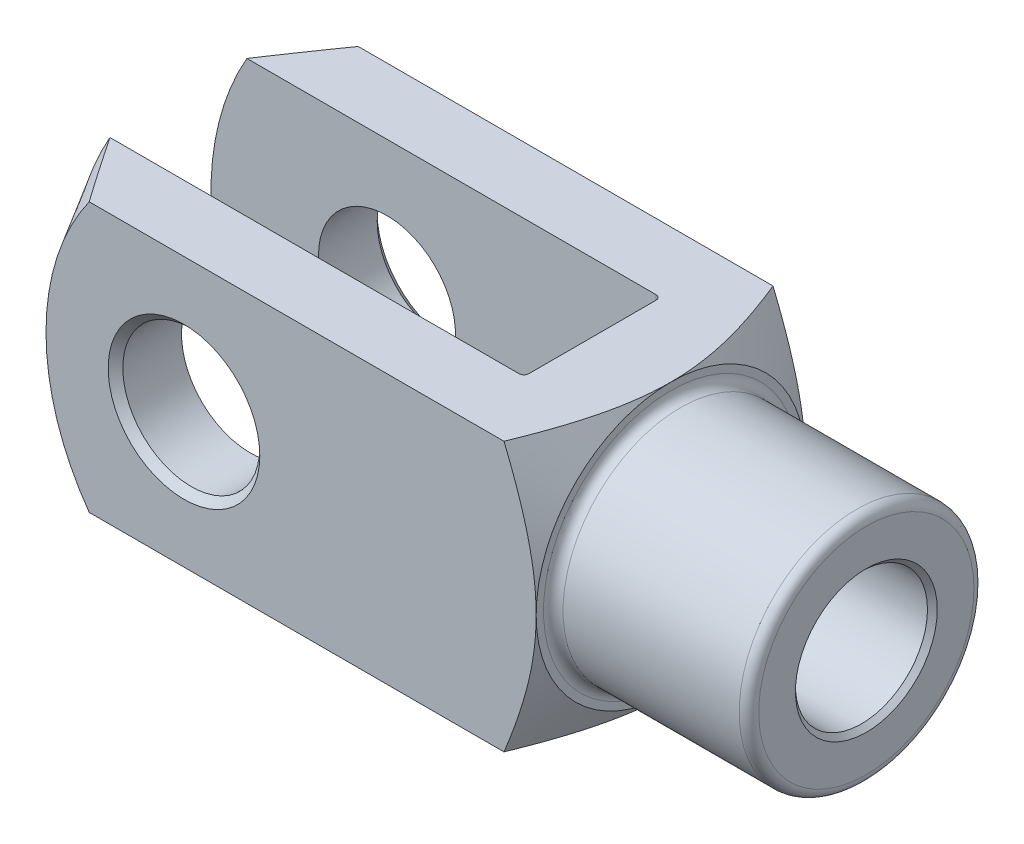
ISO-10303-21;
HEADER;
FILE_DESCRIPTION(('STEP AP214'),'2;1');
FILE_NAME('part.step','',(''),(''),'','','');
FILE_SCHEMA(('AUTOMOTIVE_DESIGN { 1 0 10303 214 1 1 1 1 }'));
ENDSEC;
DATA;
#1=APPLICATION_CONTEXT('core data for automotive mechanical design processes');
#2=APPLICATION_PROTOCOL_DEFINITION('international standard','automotive_design',2000,#1);
#3=PRODUCT_CONTEXT('',#1,'mechanical');
#4=PRODUCT('Part','Part','',(#3));
#5=PRODUCT_RELATED_PRODUCT_CATEGORY('part','',(#4));
#6=PRODUCT_DEFINITION_FORMATION('','',#4);
#7=PRODUCT_DEFINITION_CONTEXT('part definition',#1,'design');
#8=PRODUCT_DEFINITION('design','',#6,#7);
#9=PRODUCT_DEFINITION_SHAPE('','',#8);
#10=(LENGTH_UNIT() NAMED_UNIT(*) SI_UNIT(.MILLI.,.METRE.));
#11=(NAMED_UNIT(*) PLANE_ANGLE_UNIT() SI_UNIT($,.RADIAN.));
#12=(NAMED_UNIT(*) SI_UNIT($,.STERADIAN.) SOLID_ANGLE_UNIT());
#13=UNCERTAINTY_MEASURE_WITH_UNIT(LENGTH_MEASURE(1.E-05),#10,'distance_accuracy_value','');
#14=(GEOMETRIC_REPRESENTATION_CONTEXT(3) GLOBAL_UNCERTAINTY_ASSIGNED_CONTEXT((#13)) GLOBAL_UNIT_ASSIGNED_CONTEXT((#10,
#11,#12)) REPRESENTATION_CONTEXT('',''));
#15=CARTESIAN_POINT('',(0.,0.,0.));
#16=DIRECTION('',(0.,0.,1.));
#17=DIRECTION('',(1.,0.,0.));
#18=AXIS2_PLACEMENT_3D('',#15,#16,#17);
#19=CARTESIAN_POINT('',(-56.,-27.5,-14.));
#20=DIRECTION('',(1.,0.,0.));
#21=DIRECTION('',(0.,0.,-1.));
#22=AXIS2_PLACEMENT_3D('',#19,#20,#21);
#23=PLANE('',#22);
#24=DIRECTION('',(0.,1.,0.));
#25=VECTOR('',#24,1.);
#26=CARTESIAN_POINT('',(-56.,-27.5,-13.));
#27=LINE('',#26,#25);
#28=CARTESIAN_POINT('',(-56.,27.5,-13.));
#29=VERTEX_POINT('',#28);
#30=CARTESIAN_POINT('',(-56.,3.6400549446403,-13.));
#31=VERTEX_POINT('',#30);
#32=EDGE_CURVE('E154',#29,#31,#27,.F.);
#33=ORIENTED_EDGE('',*,*,#32,.T.);
#34=CARTESIAN_POINT('',(-56.,0.,0.));
#35=DIRECTION('',(1.,0.,0.));
#36=DIRECTION('',(0.,0.,-1.));
#37=AXIS2_PLACEMENT_3D('',#34,#35,#36);
#38=CIRCLE('',#37,13.5);
#39=CARTESIAN_POINT('',(-56.,3.64005494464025,13.));
#40=VERTEX_POINT('',#39);
#41=EDGE_CURVE('E139',#31,#40,#38,.T.);
#42=ORIENTED_EDGE('',*,*,#41,.T.);
#43=DIRECTION('',(0.,1.,0.));
#44=VECTOR('',#43,1.);
#45=CARTESIAN_POINT('',(-56.,27.5,13.));
#46=LINE('',#45,#44);
#47=CARTESIAN_POINT('',(-56.,27.5,13.));
#48=VERTEX_POINT('',#47);
#49=EDGE_CURVE('E151',#40,#48,#46,.T.);
#50=ORIENTED_EDGE('',*,*,#49,.T.);
#51=DIRECTION('',(0.,0.,-1.));
#52=VECTOR('',#51,1.);
#53=CARTESIAN_POINT('',(-56.,27.5,-14.));
#54=LINE('',#53,#52);
#55=EDGE_CURVE('E329',#48,#29,#54,.T.);
#56=ORIENTED_EDGE('',*,*,#55,.T.);
#57=EDGE_LOOP('',(#33,#42,#50,#56));
#58=FACE_BOUND('',#57,.T.);
#59=ADVANCED_FACE('F37',(#58),#23,.F.);
#60=CARTESIAN_POINT('',(-148.,-27.5,-14.));
#61=DIRECTION('',(0.,0.,-1.));
#62=DIRECTION('',(-1.,0.,0.));
#63=AXIS2_PLACEMENT_3D('',#60,#61,#62);
#64=PLANE('',#63);
#65=CARTESIAN_POINT('',(-112.,0.,-14.));
#66=DIRECTION('',(0.,0.,-1.));
#67=DIRECTION('',(-1.,0.,0.));
#68=AXIS2_PLACEMENT_3D('',#65,#66,#67);
#69=CIRCLE('',#68,14.);
#70=CARTESIAN_POINT('',(-126.,0.,-14.));
#71=VERTEX_POINT('',#70);
#72=EDGE_CURVE('E358',#71,#71,#69,.F.);
#73=ORIENTED_EDGE('',*,*,#72,.F.);
#74=EDGE_LOOP('',(#73));
#75=FACE_BOUND('',#74,.T.);
#76=DIRECTION('',(-1.,0.,0.));
#77=VECTOR('',#76,1.);
#78=CARTESIAN_POINT('',(-148.,27.5,-14.));
#79=LINE('',#78,#77);
#80=CARTESIAN_POINT('',(-57.,27.5,-14.));
#81=VERTEX_POINT('',#80);
#82=CARTESIAN_POINT('',(-140.631397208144,27.5,-14.));
#83=VERTEX_POINT('',#82);
#84=EDGE_CURVE('E337',#81,#83,#79,.T.);
#85=ORIENTED_EDGE('',*,*,#84,.T.);
#86=CARTESIAN_POINT('',(-93.,0.,-14.));
#87=DIRECTION('',(0.,0.,1.));
#88=DIRECTION('',(1.,0.,0.));
#89=AXIS2_PLACEMENT_3D('',#86,#87,#88);
#90=CIRCLE('',#89,55.);
#91=CARTESIAN_POINT('',(-140.631397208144,-27.5,-14.));
#92=VERTEX_POINT('',#91);
#93=EDGE_CURVE('E268',#83,#92,#90,.T.);
#94=ORIENTED_EDGE('',*,*,#93,.T.);
#95=DIRECTION('',(-1.,0.,0.));
#96=VECTOR('',#95,1.);
#97=CARTESIAN_POINT('',(-148.,-27.5,-14.));
#98=LINE('',#97,#96);
#99=CARTESIAN_POINT('',(-57.,-27.5,-14.));
#100=VERTEX_POINT('',#99);
#101=EDGE_CURVE('E324',#100,#92,#98,.T.);
#102=ORIENTED_EDGE('',*,*,#101,.F.);
#103=DIRECTION('',(0.,1.,0.));
#104=VECTOR('',#103,1.);
#105=CARTESIAN_POINT('',(-57.,27.5,-14.));
#106=LINE('',#105,#104);
#107=EDGE_CURVE('E178',#100,#81,#106,.T.);
#108=ORIENTED_EDGE('',*,*,#107,.T.);
#109=EDGE_LOOP('',(#85,#94,#102,#108));
#110=FACE_BOUND('',#109,.T.);
#111=ADVANCED_FACE('F368',(#75,#110),#64,.F.);
#112=CARTESIAN_POINT('',(-148.,-27.5,14.));
#113=DIRECTION('',(0.,0.,1.));
#114=DIRECTION('',(1.,0.,0.));
#115=AXIS2_PLACEMENT_3D('',#112,#113,#114);
#116=PLANE('',#115);
#117=CARTESIAN_POINT('',(-112.,0.,14.));
#118=DIRECTION('',(0.,0.,1.));
#119=DIRECTION('',(1.,0.,0.));
#120=AXIS2_PLACEMENT_3D('',#117,#118,#119);
#121=CIRCLE('',#120,14.);
#122=CARTESIAN_POINT('',(-98.,0.,14.));
#123=VERTEX_POINT('',#122);
#124=EDGE_CURVE('E336',#123,#123,#121,.F.);
#125=ORIENTED_EDGE('',*,*,#124,.F.);
#126=EDGE_LOOP('',(#125));
#127=FACE_BOUND('',#126,.T.);
#128=CARTESIAN_POINT('',(-93.,0.,14.));
#129=DIRECTION('',(0.,0.,1.));
#130=DIRECTION('',(1.,0.,0.));
#131=AXIS2_PLACEMENT_3D('',#128,#129,#130);
#132=CIRCLE('',#131,55.);
#133=CARTESIAN_POINT('',(-140.631397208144,27.5,14.));
#134=VERTEX_POINT('',#133);
#135=CARTESIAN_POINT('',(-140.631397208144,-27.5,14.));
#136=VERTEX_POINT('',#135);
#137=EDGE_CURVE('E408',#134,#136,#132,.T.);
#138=ORIENTED_EDGE('',*,*,#137,.F.);
#139=DIRECTION('',(1.,0.,0.));
#140=VECTOR('',#139,1.);
#141=CARTESIAN_POINT('',(-148.,27.5,14.));
#142=LINE('',#141,#140);
#143=CARTESIAN_POINT('',(-57.,27.5,14.));
#144=VERTEX_POINT('',#143);
#145=EDGE_CURVE('E341',#134,#144,#142,.T.);
#146=ORIENTED_EDGE('',*,*,#145,.T.);
#147=DIRECTION('',(0.,1.,0.));
#148=VECTOR('',#147,1.);
#149=CARTESIAN_POINT('',(-57.,-27.5,14.));
#150=LINE('',#149,#148);
#151=CARTESIAN_POINT('',(-57.,-27.5,14.));
#152=VERTEX_POINT('',#151);
#153=EDGE_CURVE('E169',#144,#152,#150,.F.);
#154=ORIENTED_EDGE('',*,*,#153,.T.);
#155=DIRECTION('',(1.,0.,0.));
#156=VECTOR('',#155,1.);
#157=CARTESIAN_POINT('',(-148.,-27.5,14.));
#158=LINE('',#157,#156);
#159=EDGE_CURVE('E328',#136,#152,#158,.T.);
#160=ORIENTED_EDGE('',*,*,#159,.F.);
#161=EDGE_LOOP('',(#138,#146,#154,#160));
#162=FACE_BOUND('',#161,.T.);
#163=ADVANCED_FACE('F371',(#127,#162),#116,.F.);
#164=CARTESIAN_POINT('',(-148.,-27.5,27.5));
#165=DIRECTION('',(0.,0.,1.));
#166=DIRECTION('',(1.,0.,0.));
#167=AXIS2_PLACEMENT_3D('',#164,#165,#166);
#168=PLANE('',#167);
#169=CARTESIAN_POINT('',(-112.,0.,27.5));
#170=DIRECTION('',(0.,0.,1.));
#171=DIRECTION('',(1.,0.,0.));
#172=AXIS2_PLACEMENT_3D('',#169,#170,#171);
#173=CIRCLE('',#172,15.5);
#174=CARTESIAN_POINT('',(-96.5,0.,27.5));
#175=VERTEX_POINT('',#174);
#176=EDGE_CURVE('E221',#175,#175,#173,.F.);
#177=ORIENTED_EDGE('',*,*,#176,.T.);
#178=EDGE_LOOP('',(#177));
#179=FACE_BOUND('',#178,.T.);
#180=DIRECTION('',(1.,0.,0.));
#181=VECTOR('',#180,1.);
#182=CARTESIAN_POINT('',(-148.,27.5,27.5));
#183=LINE('',#182,#181);
#184=CARTESIAN_POINT('',(-131.368409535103,27.5,27.5));
#185=VERTEX_POINT('',#184);
#186=CARTESIAN_POINT('',(-46.5765235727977,27.5,27.5));
#187=VERTEX_POINT('',#186);
#188=EDGE_CURVE('E355',#185,#187,#183,.T.);
#189=ORIENTED_EDGE('',*,*,#188,.F.);
#190=CARTESIAN_POINT('',(-93.,0.,27.5));
#191=DIRECTION('',(0.,0.,1.));
#192=DIRECTION('',(1.,0.,0.));
#193=AXIS2_PLACEMENT_3D('',#190,#191,#192);
#194=CIRCLE('',#193,47.20577136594);
#195=CARTESIAN_POINT('',(-131.368409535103,-27.5,27.5));
#196=VERTEX_POINT('',#195);
#197=EDGE_CURVE('E61',#185,#196,#194,.T.);
#198=ORIENTED_EDGE('',*,*,#197,.T.);
#199=DIRECTION('',(1.,0.,0.));
#200=VECTOR('',#199,1.);
#201=CARTESIAN_POINT('',(-148.,-27.5,27.5));
#202=LINE('',#201,#200);
#203=CARTESIAN_POINT('',(-46.5765235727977,-27.5,27.5));
#204=VERTEX_POINT('',#203);
#205=EDGE_CURVE('E352',#196,#204,#202,.T.);
#206=ORIENTED_EDGE('',*,*,#205,.T.);
#207=CARTESIAN_POINT('',(-60.2286520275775,-56.1661197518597,27.5));
#208=CARTESIAN_POINT('',(-59.877263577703,-55.488454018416,27.5));
#209=CARTESIAN_POINT('',(-59.5268382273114,-54.8102891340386,27.5));
#210=CARTESIAN_POINT('',(-58.8281196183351,-53.4528592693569,27.5));
#211=CARTESIAN_POINT('',(-58.4798263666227,-52.7735942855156,27.5));
#212=CARTESIAN_POINT('',(-57.4384219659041,-50.7339344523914,27.5));
#213=CARTESIAN_POINT('',(-56.748821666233,-49.3717430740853,27.5));
#214=CARTESIAN_POINT('',(-55.379898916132,-46.6392326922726,27.5));
#215=CARTESIAN_POINT('',(-54.700596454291,-45.2689036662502,27.5));
#216=CARTESIAN_POINT('',(-53.3562706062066,-42.5212693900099,27.5));
#217=CARTESIAN_POINT('',(-52.6912469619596,-41.1439642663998,27.5));
#218=CARTESIAN_POINT('',(-51.6870177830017,-39.0290973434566,27.5));
#219=CARTESIAN_POINT('',(-51.3413523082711,-38.2946014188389,27.5));
#220=CARTESIAN_POINT('',(-50.6557933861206,-36.8229224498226,27.5));
#221=CARTESIAN_POINT('',(-50.3158999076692,-36.0857394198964,27.5));
#222=CARTESIAN_POINT('',(-49.6426674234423,-34.6083269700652,27.5));
#223=CARTESIAN_POINT('',(-49.3093288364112,-33.8680973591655,27.5));
#224=CARTESIAN_POINT('',(-48.6501852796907,-32.3842946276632,27.5));
#225=CARTESIAN_POINT('',(-48.3243802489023,-31.6407215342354,27.5));
#226=CARTESIAN_POINT('',(-47.6815641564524,-30.1501576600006,27.5));
#227=CARTESIAN_POINT('',(-47.3645493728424,-29.4031684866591,27.5));
#228=CARTESIAN_POINT('',(-46.7405004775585,-27.9050353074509,27.5));
#229=CARTESIAN_POINT('',(-46.4334662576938,-27.1538913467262,27.5));
#230=CARTESIAN_POINT('',(-45.8309720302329,-25.6470429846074,27.5));
#231=CARTESIAN_POINT('',(-45.5355109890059,-24.8913389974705,27.5));
#232=CARTESIAN_POINT('',(-44.9579969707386,-23.374828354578,27.5));
#233=CARTESIAN_POINT('',(-44.6759438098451,-22.6140217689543,27.5));
#234=CARTESIAN_POINT('',(-44.0679304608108,-20.9211908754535,27.5));
#235=CARTESIAN_POINT('',(-43.7457124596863,-19.9878144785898,27.5));
#236=CARTESIAN_POINT('',(-43.1290045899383,-18.1119849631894,27.5));
#237=CARTESIAN_POINT('',(-42.8345123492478,-17.1695326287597,27.5));
#238=CARTESIAN_POINT('',(-42.2787221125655,-15.2748429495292,27.5));
#239=CARTESIAN_POINT('',(-42.0174234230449,-14.3226058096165,27.5));
#240=CARTESIAN_POINT('',(-41.5342616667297,-12.4080936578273,27.5));
#241=CARTESIAN_POINT('',(-41.3123981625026,-11.4458187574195,27.5));
#242=CARTESIAN_POINT('',(-40.9194598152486,-9.53441211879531,27.5));
#243=CARTESIAN_POINT('',(-40.7473150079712,-8.58550210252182,27.5));
#244=CARTESIAN_POINT('',(-40.4530867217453,-6.67982263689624,27.5));
#245=CARTESIAN_POINT('',(-40.331001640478,-5.72305344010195,27.5));
#246=CARTESIAN_POINT('',(-40.1891957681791,-4.2842070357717,27.5));
#247=CARTESIAN_POINT('',(-40.1488192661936,-3.80410222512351,27.5));
#248=CARTESIAN_POINT('',(-40.0822400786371,-2.8429183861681,27.5));
#249=CARTESIAN_POINT('',(-40.0560367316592,-2.36183940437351,27.5));
#250=CARTESIAN_POINT('',(-40.0181172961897,-1.39910944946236,27.5));
#251=CARTESIAN_POINT('',(-40.0064011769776,-0.917458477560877,27.5));
#252=CARTESIAN_POINT('',(-39.9975849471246,0.0459618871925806,27.5));
#253=CARTESIAN_POINT('',(-40.0004847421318,0.52773127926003,27.5));
#254=CARTESIAN_POINT('',(-40.0296149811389,1.90235979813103,27.5));
#255=CARTESIAN_POINT('',(-40.0736560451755,2.79490249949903,27.5));
#256=CARTESIAN_POINT('',(-40.2102476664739,4.57617108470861,27.5));
#257=CARTESIAN_POINT('',(-40.3027981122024,5.4648969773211,27.5));
#258=CARTESIAN_POINT('',(-40.5329956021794,7.2369038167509,27.5));
#259=CARTESIAN_POINT('',(-40.6706659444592,8.1201817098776,27.5));
#260=CARTESIAN_POINT('',(-40.9865696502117,9.87940375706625,27.5));
#261=CARTESIAN_POINT('',(-41.1648041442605,10.7553477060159,27.5));
#262=CARTESIAN_POINT('',(-41.5625503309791,12.5244022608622,27.5));
#263=CARTESIAN_POINT('',(-41.7831074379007,13.4172759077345,27.5));
#264=CARTESIAN_POINT('',(-42.2566003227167,15.1943548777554,27.5));
#265=CARTESIAN_POINT('',(-42.5095364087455,16.0785601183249,27.5));
#266=CARTESIAN_POINT('',(-42.9095547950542,17.3985328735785,27.5));
#267=CARTESIAN_POINT('',(-43.0463285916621,17.8374638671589,27.5));
#268=CARTESIAN_POINT('',(-43.3262073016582,18.7133062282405,27.5));
#269=CARTESIAN_POINT('',(-43.469312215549,19.1502175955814,27.5));
#270=CARTESIAN_POINT('',(-43.7613249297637,20.0220652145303,27.5));
#271=CARTESIAN_POINT('',(-43.9102323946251,20.4570015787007,27.5));
#272=CARTESIAN_POINT('',(-44.2133836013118,21.3250056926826,27.5));
#273=CARTESIAN_POINT('',(-44.3676273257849,21.7580734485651,27.5));
#274=CARTESIAN_POINT('',(-44.8632318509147,23.1250498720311,27.5));
#275=CARTESIAN_POINT('',(-45.2135920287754,24.0557046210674,27.5));
#276=CARTESIAN_POINT('',(-45.9333349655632,25.9096511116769,27.5));
#277=CARTESIAN_POINT('',(-46.3027188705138,26.8329424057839,27.5));
#278=CARTESIAN_POINT('',(-47.0574378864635,28.6732112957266,27.5));
#279=CARTESIAN_POINT('',(-47.4427765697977,29.59018742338,27.5));
#280=CARTESIAN_POINT('',(-48.2267507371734,31.4184035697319,27.5));
#281=CARTESIAN_POINT('',(-48.6253859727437,32.3296436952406,27.5));
#282=CARTESIAN_POINT('',(-49.4342203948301,34.1479110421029,27.5));
#283=CARTESIAN_POINT('',(-49.8444292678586,35.054933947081,27.5));
#284=CARTESIAN_POINT('',(-50.6743730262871,36.8646088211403,27.5));
#285=CARTESIAN_POINT('',(-51.0941079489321,37.767260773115,27.5));
#286=CARTESIAN_POINT('',(-51.9416536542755,39.5686363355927,27.5));
#287=CARTESIAN_POINT('',(-52.3694635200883,40.4673603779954,27.5));
#288=CARTESIAN_POINT('',(-53.2320518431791,42.2614529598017,27.5));
#289=CARTESIAN_POINT('',(-53.6668302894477,43.1568215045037,27.5));
#290=CARTESIAN_POINT('',(-54.5437336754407,44.9473331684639,27.5));
#291=CARTESIAN_POINT('',(-54.9858769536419,45.8424672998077,27.5));
#292=CARTESIAN_POINT('',(-55.8754180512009,47.6301222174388,27.5));
#293=CARTESIAN_POINT('',(-56.3228158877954,48.5226429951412,27.5));
#294=CARTESIAN_POINT('',(-57.6718703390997,51.1967817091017,27.5));
#295=CARTESIAN_POINT('',(-58.5803735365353,52.9749468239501,27.5));
#296=CARTESIAN_POINT('',(-60.4109841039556,56.5231320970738,27.5));
#297=CARTESIAN_POINT('',(-61.3330845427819,58.2931558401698,27.5));
#298=CARTESIAN_POINT('',(-63.1883406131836,61.8273779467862,27.5));
#299=CARTESIAN_POINT('',(-64.1214961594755,63.5915763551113,27.5));
#300=CARTESIAN_POINT('',(-65.8574160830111,66.8536122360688,27.5));
#301=CARTESIAN_POINT('',(-66.6589641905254,68.3520976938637,27.5));
#302=CARTESIAN_POINT('',(-68.2674305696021,71.34618514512,27.5));
#303=CARTESIAN_POINT('',(-69.0743488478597,72.8417871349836,27.5));
#304=CARTESIAN_POINT('',(-70.6928273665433,75.8307473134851,27.5));
#305=CARTESIAN_POINT('',(-71.5043882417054,77.3241051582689,27.5));
#306=CARTESIAN_POINT('',(-73.1313659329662,80.3087190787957,27.5));
#307=CARTESIAN_POINT('',(-73.9467827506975,81.7999751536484,27.5));
#308=CARTESIAN_POINT('',(-75.5762426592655,84.7721370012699,27.5));
#309=CARTESIAN_POINT('',(-76.3902668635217,86.2530531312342,27.5));
#310=CARTESIAN_POINT('',(-78.0211422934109,89.2133282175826,27.5));
#311=CARTESIAN_POINT('',(-78.8379935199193,90.6926871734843,27.5));
#312=CARTESIAN_POINT('',(-80.4740235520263,93.6498117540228,27.5));
#313=CARTESIAN_POINT('',(-81.2932019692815,95.1275775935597,27.5));
#314=CARTESIAN_POINT('',(-82.9337176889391,98.0819083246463,27.5));
#315=CARTESIAN_POINT('',(-83.755054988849,99.5584732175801,27.5));
#316=CARTESIAN_POINT('',(-84.5773240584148,101.034518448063,27.5));
#317=B_SPLINE_CURVE_WITH_KNOTS('',3,(#207,#208,#209,#210,#211,#212,#213,#214,#215,#216,#217,
#218,#219,#220,#221,#222,#223,#224,#225,#226,#227,#228,#229,#230,#231,#232,#233,#234,#235,#236,
#237,#238,#239,#240,#241,#242,#243,#244,#245,#246,#247,#248,#249,#250,#251,#252,#253,#254,#255,
#256,#257,#258,#259,#260,#261,#262,#263,#264,#265,#266,#267,#268,#269,#270,#271,#272,#273,#274,
#275,#276,#277,#278,#279,#280,#281,#282,#283,#284,#285,#286,#287,#288,#289,#290,#291,#292,#293,
#294,#295,#296,#297,#298,#299,#300,#301,#302,#303,#304,#305,#306,#307,#308,#309,#310,#311,#312,
#313,#314,#315,#316),.UNSPECIFIED.,.F.,.F.,(4,2,2,2,2,2,2,2,2,2,2,2,2,2,2,2,2,2,2,2,2,2,2,2,2,2,
2,2,2,2,2,2,2,2,2,2,2,2,2,2,2,2,2,2,2,2,2,2,2,2,2,2,2,2,4),(0.,2.29005127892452,
4.58010993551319,9.1604583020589,13.7487827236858,18.3370241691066,20.7723109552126,
23.2075846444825,25.643013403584,28.0784224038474,30.5127839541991,32.9471191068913,
35.3812363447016,37.8153201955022,40.7772407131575,43.7389075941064,46.7005125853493,
49.6620847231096,52.5541365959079,55.4460958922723,56.8913195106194,58.3364756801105,
59.7816287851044,61.2267725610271,63.9061566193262,66.5855345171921,69.2662981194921,
71.9471364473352,74.7055692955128,77.4640283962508,78.8432321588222,80.2224360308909,
81.6015602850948,82.9806800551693,85.9636558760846,88.9468116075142,91.9306389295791,
94.9144105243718,97.9007581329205,100.887117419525,103.873139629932,106.859157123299,
109.85426683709,112.849386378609,118.839723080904,124.827105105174,130.814440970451,
135.912609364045,141.010784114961,146.109673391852,151.208564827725,156.27824886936,
161.347934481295,166.416818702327,171.485697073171),.UNSPECIFIED.);
#318=CARTESIAN_POINT('',(-40.,0.,27.5));
#319=VERTEX_POINT('',#318);
#320=EDGE_CURVE('E296',#319,#204,#317,.F.);
#321=ORIENTED_EDGE('',*,*,#320,.F.);
#322=EDGE_CURVE('E294',#187,#319,#317,.F.);
#323=ORIENTED_EDGE('',*,*,#322,.F.);
#324=EDGE_LOOP('',(#189,#198,#206,#321,#323));
#325=FACE_BOUND('',#324,.T.);
#326=ADVANCED_FACE('F279',(#179,#325),#168,.T.);
#327=CARTESIAN_POINT('',(-148.,-27.5,27.5));
#328=DIRECTION('',(0.,-1.,0.));
#329=DIRECTION('',(0.,0.,-1.));
#330=AXIS2_PLACEMENT_3D('',#327,#328,#329);
#331=PLANE('',#330);
#332=ORIENTED_EDGE('',*,*,#101,.T.);
#333=CARTESIAN_POINT('',(-175.072820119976,-27.5,40.6591633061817));
#334=CARTESIAN_POINT('',(-174.314077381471,-27.5,39.4130762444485));
#335=CARTESIAN_POINT('',(-173.554564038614,-27.5,38.1674584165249));
#336=CARTESIAN_POINT('',(-172.033855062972,-27.5,35.6772496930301));
#337=CARTESIAN_POINT('',(-171.272659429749,-27.5,34.4326587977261));
#338=CARTESIAN_POINT('',(-168.986325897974,-27.5,30.700540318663));
#339=CARTESIAN_POINT('',(-167.458453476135,-27.5,28.21468683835));
#340=CARTESIAN_POINT('',(-164.393853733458,-27.5,23.248032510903));
#341=CARTESIAN_POINT('',(-162.857125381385,-27.5,20.767232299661));
#342=CARTESIAN_POINT('',(-160.544189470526,-27.5,17.0509206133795));
#343=CARTESIAN_POINT('',(-159.771905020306,-27.5,15.8129670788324));
#344=CARTESIAN_POINT('',(-158.224440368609,-27.5,13.3388665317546));
#345=CARTESIAN_POINT('',(-157.449260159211,-27.5,12.1027195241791));
#346=CARTESIAN_POINT('',(-155.122376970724,-27.5,8.40276427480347));
#347=CARTESIAN_POINT('',(-153.565914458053,-27.5,5.94194577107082));
#348=CARTESIAN_POINT('',(-150.437298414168,-27.5,1.03030295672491));
#349=CARTESIAN_POINT('',(-148.865144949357,-27.5,-1.42052139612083));
#350=CARTESIAN_POINT('',(-146.49201790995,-27.5,-5.08719073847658));
#351=CARTESIAN_POINT('',(-145.698475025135,-27.5,-6.30784623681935));
#352=CARTESIAN_POINT('',(-144.105765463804,-27.5,-8.74548151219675));
#353=CARTESIAN_POINT('',(-143.306598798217,-27.5,-9.96246129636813));
#354=CARTESIAN_POINT('',(-141.701880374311,-27.5,-12.3921897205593));
#355=CARTESIAN_POINT('',(-140.896328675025,-27.5,-13.6049383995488));
#356=CARTESIAN_POINT('',(-139.277910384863,-27.5,-16.0255422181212));
#357=CARTESIAN_POINT('',(-138.465043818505,-27.5,-17.2333973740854));
#358=CARTESIAN_POINT('',(-136.829559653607,-27.5,-19.6453400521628));
#359=CARTESIAN_POINT('',(-136.006928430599,-27.5,-20.8494183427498));
#360=CARTESIAN_POINT('',(-134.351848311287,-27.5,-23.2508006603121));
#361=CARTESIAN_POINT('',(-133.519399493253,-27.5,-24.4481047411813));
#362=CARTESIAN_POINT('',(-131.843199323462,-27.5,-26.8343488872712));
#363=CARTESIAN_POINT('',(-130.999450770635,-27.5,-28.0232909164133));
#364=CARTESIAN_POINT('',(-129.2983336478,-27.5,-30.39145409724));
#365=CARTESIAN_POINT('',(-128.440964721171,-27.5,-31.5706749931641));
#366=CARTESIAN_POINT('',(-126.708925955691,-27.5,-33.9185712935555));
#367=CARTESIAN_POINT('',(-125.834236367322,-27.5,-35.0872321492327));
#368=CARTESIAN_POINT('',(-124.065221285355,-27.5,-37.4095168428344));
#369=CARTESIAN_POINT('',(-123.170897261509,-27.5,-38.5631417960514));
#370=CARTESIAN_POINT('',(-121.81093952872,-27.5,-40.2796624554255));
#371=CARTESIAN_POINT('',(-121.354359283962,-27.5,-40.8497370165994));
#372=CARTESIAN_POINT('',(-120.434440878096,-27.5,-41.9843978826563));
#373=CARTESIAN_POINT('',(-119.971102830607,-27.5,-42.5489842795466));
#374=CARTESIAN_POINT('',(-119.036762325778,-27.5,-43.6720267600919));
#375=CARTESIAN_POINT('',(-118.565757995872,-27.5,-44.2304812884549));
#376=CARTESIAN_POINT('',(-117.615206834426,-27.5,-45.3401243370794));
#377=CARTESIAN_POINT('',(-117.135659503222,-27.5,-45.8913124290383));
#378=CARTESIAN_POINT('',(-116.651373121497,-27.5,-46.4383377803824));
#379=B_SPLINE_CURVE_WITH_KNOTS('',3,(#333,#334,#335,#336,#337,#338,#339,#340,#341,#342,#343,
#344,#345,#346,#347,#348,#349,#350,#351,#352,#353,#354,#355,#356,#357,#358,#359,#360,#361,#362,
#363,#364,#365,#366,#367,#368,#369,#370,#371,#372,#373,#374,#375,#376,#377,#378),.UNSPECIFIED.,
.F.,.F.,(4,2,2,2,2,2,2,2,2,2,2,2,2,2,2,2,2,2,2,2,2,2,4),(0.,4.3767348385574,8.75347081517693,
17.5070126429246,26.2615952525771,30.638870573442,35.016157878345,43.7513177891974,
52.4864407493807,56.8541956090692,61.2219419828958,65.5896480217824,69.9573394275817,
74.3320826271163,78.7067909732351,83.0804350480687,87.4541938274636,91.8332651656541,
96.2120098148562,98.4030985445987,100.594150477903,102.785745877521,104.977469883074),.UNSPECIFIED.);
#380=CARTESIAN_POINT('',(-131.368409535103,-27.5,-27.5));
#381=VERTEX_POINT('',#380);
#382=EDGE_CURVE('E267',#92,#381,#379,.T.);
#383=ORIENTED_EDGE('',*,*,#382,.T.);
#384=DIRECTION('',(1.,0.,0.));
#385=VECTOR('',#384,1.);
#386=CARTESIAN_POINT('',(-148.,-27.5,-27.5));
#387=LINE('',#386,#385);
#388=CARTESIAN_POINT('',(-46.5765235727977,-27.5,-27.5));
#389=VERTEX_POINT('',#388);
#390=EDGE_CURVE('E349',#381,#389,#387,.T.);
#391=ORIENTED_EDGE('',*,*,#390,.T.);
#392=CARTESIAN_POINT('',(-60.2286520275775,-27.5,-56.1661197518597));
#393=CARTESIAN_POINT('',(-59.877263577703,-27.5,-55.488454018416));
#394=CARTESIAN_POINT('',(-59.5268382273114,-27.5,-54.8102891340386));
#395=CARTESIAN_POINT('',(-58.8281196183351,-27.5,-53.4528592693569));
#396=CARTESIAN_POINT('',(-58.4798263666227,-27.5,-52.7735942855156));
#397=CARTESIAN_POINT('',(-57.4384219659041,-27.5,-50.7339344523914));
#398=CARTESIAN_POINT('',(-56.748821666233,-27.5,-49.3717430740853));
#399=CARTESIAN_POINT('',(-55.379898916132,-27.5,-46.6392326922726));
#400=CARTESIAN_POINT('',(-54.700596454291,-27.5,-45.2689036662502));
#401=CARTESIAN_POINT('',(-53.3562706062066,-27.5,-42.5212693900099));
#402=CARTESIAN_POINT('',(-52.6912469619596,-27.5,-41.1439642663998));
#403=CARTESIAN_POINT('',(-51.6870177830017,-27.5,-39.0290973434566));
#404=CARTESIAN_POINT('',(-51.3413523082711,-27.5,-38.2946014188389));
#405=CARTESIAN_POINT('',(-50.6557933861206,-27.5,-36.8229224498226));
#406=CARTESIAN_POINT('',(-50.3158999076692,-27.5,-36.0857394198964));
#407=CARTESIAN_POINT('',(-49.6426674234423,-27.5,-34.6083269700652));
#408=CARTESIAN_POINT('',(-49.3093288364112,-27.5,-33.8680973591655));
#409=CARTESIAN_POINT('',(-48.6501852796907,-27.5,-32.3842946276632));
#410=CARTESIAN_POINT('',(-48.3243802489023,-27.5,-31.6407215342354));
#411=CARTESIAN_POINT('',(-47.6815641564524,-27.5,-30.1501576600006));
#412=CARTESIAN_POINT('',(-47.3645493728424,-27.5,-29.4031684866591));
#413=CARTESIAN_POINT('',(-46.7405004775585,-27.5,-27.9050353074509));
#414=CARTESIAN_POINT('',(-46.4334662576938,-27.5,-27.1538913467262));
#415=CARTESIAN_POINT('',(-45.8309720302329,-27.5,-25.6470429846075));
#416=CARTESIAN_POINT('',(-45.535510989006,-27.5,-24.8913389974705));
#417=CARTESIAN_POINT('',(-44.9579969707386,-27.5,-23.374828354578));
#418=CARTESIAN_POINT('',(-44.6759438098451,-27.5,-22.6140217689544));
#419=CARTESIAN_POINT('',(-44.0679304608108,-27.5,-20.9211908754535));
#420=CARTESIAN_POINT('',(-43.7457124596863,-27.5,-19.9878144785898));
#421=CARTESIAN_POINT('',(-43.1290045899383,-27.5,-18.1119849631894));
#422=CARTESIAN_POINT('',(-42.8345123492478,-27.5,-17.1695326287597));
#423=CARTESIAN_POINT('',(-42.2787221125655,-27.5,-15.2748429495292));
#424=CARTESIAN_POINT('',(-42.0174234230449,-27.5,-14.3226058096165));
#425=CARTESIAN_POINT('',(-41.5342616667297,-27.5,-12.4080936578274));
#426=CARTESIAN_POINT('',(-41.3123981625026,-27.5,-11.4458187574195));
#427=CARTESIAN_POINT('',(-40.9194598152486,-27.5,-9.53441211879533));
#428=CARTESIAN_POINT('',(-40.7473150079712,-27.5,-8.58550210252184));
#429=CARTESIAN_POINT('',(-40.4530867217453,-27.5,-6.67982263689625));
#430=CARTESIAN_POINT('',(-40.331001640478,-27.5,-5.72305344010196));
#431=CARTESIAN_POINT('',(-40.1891957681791,-27.5,-4.28420703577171));
#432=CARTESIAN_POINT('',(-40.1488192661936,-27.5,-3.80410222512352));
#433=CARTESIAN_POINT('',(-40.0822400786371,-27.5,-2.84291838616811));
#434=CARTESIAN_POINT('',(-40.0560367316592,-27.5,-2.36183940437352));
#435=CARTESIAN_POINT('',(-40.0181172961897,-27.5,-1.39910944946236));
#436=CARTESIAN_POINT('',(-40.0064011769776,-27.5,-0.917458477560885));
#437=CARTESIAN_POINT('',(-39.9975849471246,-27.5,0.0459618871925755));
#438=CARTESIAN_POINT('',(-40.0004847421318,-27.5,0.527731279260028));
#439=CARTESIAN_POINT('',(-40.0296149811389,-27.5,1.90235979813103));
#440=CARTESIAN_POINT('',(-40.0736560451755,-27.5,2.79490249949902));
#441=CARTESIAN_POINT('',(-40.2102476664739,-27.5,4.5761710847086));
#442=CARTESIAN_POINT('',(-40.3027981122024,-27.5,5.46489697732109));
#443=CARTESIAN_POINT('',(-40.5329956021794,-27.5,7.2369038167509));
#444=CARTESIAN_POINT('',(-40.6706659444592,-27.5,8.1201817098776));
#445=CARTESIAN_POINT('',(-40.9865696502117,-27.5,9.87940375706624));
#446=CARTESIAN_POINT('',(-41.1648041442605,-27.5,10.7553477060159));
#447=CARTESIAN_POINT('',(-41.5625503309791,-27.5,12.5244022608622));
#448=CARTESIAN_POINT('',(-41.7831074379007,-27.5,13.4172759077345));
#449=CARTESIAN_POINT('',(-42.2566003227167,-27.5,15.1943548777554));
#450=CARTESIAN_POINT('',(-42.5095364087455,-27.5,16.0785601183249));
#451=CARTESIAN_POINT('',(-42.9095547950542,-27.5,17.3985328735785));
#452=CARTESIAN_POINT('',(-43.0463285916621,-27.5,17.8374638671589));
#453=CARTESIAN_POINT('',(-43.3262073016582,-27.5,18.7133062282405));
#454=CARTESIAN_POINT('',(-43.469312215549,-27.5,19.1502175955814));
#455=CARTESIAN_POINT('',(-43.7613249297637,-27.5,20.0220652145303));
#456=CARTESIAN_POINT('',(-43.9102323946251,-27.5,20.4570015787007));
#457=CARTESIAN_POINT('',(-44.2133836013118,-27.5,21.3250056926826));
#458=CARTESIAN_POINT('',(-44.3676273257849,-27.5,21.7580734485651));
#459=CARTESIAN_POINT('',(-44.8632318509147,-27.5,23.1250498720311));
#460=CARTESIAN_POINT('',(-45.2135920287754,-27.5,24.0557046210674));
#461=CARTESIAN_POINT('',(-45.9333349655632,-27.5,25.9096511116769));
#462=CARTESIAN_POINT('',(-46.3027188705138,-27.5,26.8329424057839));
#463=CARTESIAN_POINT('',(-47.0574378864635,-27.5,28.6732112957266));
#464=CARTESIAN_POINT('',(-47.4427765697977,-27.5,29.59018742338));
#465=CARTESIAN_POINT('',(-48.2267507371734,-27.5,31.4184035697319));
#466=CARTESIAN_POINT('',(-48.6253859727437,-27.5,32.3296436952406));
#467=CARTESIAN_POINT('',(-49.4342203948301,-27.5,34.1479110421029));
#468=CARTESIAN_POINT('',(-49.8444292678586,-27.5,35.054933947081));
#469=CARTESIAN_POINT('',(-50.6743730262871,-27.5,36.8646088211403));
#470=CARTESIAN_POINT('',(-51.0941079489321,-27.5,37.767260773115));
#471=CARTESIAN_POINT('',(-51.9416536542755,-27.5,39.5686363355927));
#472=CARTESIAN_POINT('',(-52.3694635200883,-27.5,40.4673603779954));
#473=CARTESIAN_POINT('',(-53.2320518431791,-27.5,42.2614529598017));
#474=CARTESIAN_POINT('',(-53.6668302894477,-27.5,43.1568215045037));
#475=CARTESIAN_POINT('',(-54.5437336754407,-27.5,44.9473331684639));
#476=CARTESIAN_POINT('',(-54.9858769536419,-27.5,45.8424672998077));
#477=CARTESIAN_POINT('',(-55.8754180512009,-27.5,47.6301222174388));
#478=CARTESIAN_POINT('',(-56.3228158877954,-27.5,48.5226429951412));
#479=CARTESIAN_POINT('',(-57.6718703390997,-27.5,51.1967817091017));
#480=CARTESIAN_POINT('',(-58.5803735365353,-27.5,52.9749468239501));
#481=CARTESIAN_POINT('',(-60.4109841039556,-27.5,56.5231320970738));
#482=CARTESIAN_POINT('',(-61.3330845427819,-27.5,58.2931558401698));
#483=CARTESIAN_POINT('',(-63.1883406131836,-27.5,61.8273779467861));
#484=CARTESIAN_POINT('',(-64.1214961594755,-27.5,63.5915763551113));
#485=CARTESIAN_POINT('',(-65.857416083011,-27.5,66.8536122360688));
#486=CARTESIAN_POINT('',(-66.6589641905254,-27.5,68.3520976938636));
#487=CARTESIAN_POINT('',(-68.2674305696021,-27.5,71.34618514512));
#488=CARTESIAN_POINT('',(-69.0743488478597,-27.5,72.8417871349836));
#489=CARTESIAN_POINT('',(-70.6928273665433,-27.5,75.8307473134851));
#490=CARTESIAN_POINT('',(-71.5043882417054,-27.5,77.3241051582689));
#491=CARTESIAN_POINT('',(-73.1313659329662,-27.5,80.3087190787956));
#492=CARTESIAN_POINT('',(-73.9467827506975,-27.5,81.7999751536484));
#493=CARTESIAN_POINT('',(-75.5762426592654,-27.5,84.7721370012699));
#494=CARTESIAN_POINT('',(-76.3902668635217,-27.5,86.2530531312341));
#495=CARTESIAN_POINT('',(-78.0211422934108,-27.5,89.2133282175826));
#496=CARTESIAN_POINT('',(-78.8379935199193,-27.5,90.6926871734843));
#497=CARTESIAN_POINT('',(-80.4740235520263,-27.5,93.6498117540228));
#498=CARTESIAN_POINT('',(-81.2932019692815,-27.5,95.1275775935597));
#499=CARTESIAN_POINT('',(-82.9337176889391,-27.5,98.0819083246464));
#500=CARTESIAN_POINT('',(-83.755054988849,-27.5,99.5584732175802));
#501=CARTESIAN_POINT('',(-84.5773240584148,-27.5,101.034518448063));
#502=B_SPLINE_CURVE_WITH_KNOTS('',3,(#392,#393,#394,#395,#396,#397,#398,#399,#400,#401,#402,
#403,#404,#405,#406,#407,#408,#409,#410,#411,#412,#413,#414,#415,#416,#417,#418,#419,#420,#421,
#422,#423,#424,#425,#426,#427,#428,#429,#430,#431,#432,#433,#434,#435,#436,#437,#438,#439,#440,
#441,#442,#443,#444,#445,#446,#447,#448,#449,#450,#451,#452,#453,#454,#455,#456,#457,#458,#459,
#460,#461,#462,#463,#464,#465,#466,#467,#468,#469,#470,#471,#472,#473,#474,#475,#476,#477,#478,
#479,#480,#481,#482,#483,#484,#485,#486,#487,#488,#489,#490,#491,#492,#493,#494,#495,#496,#497,
#498,#499,#500,#501),.UNSPECIFIED.,.F.,.F.,(4,2,2,2,2,2,2,2,2,2,2,2,2,2,2,2,2,2,2,2,2,2,2,2,2,2,
2,2,2,2,2,2,2,2,2,2,2,2,2,2,2,2,2,2,2,2,2,2,2,2,2,2,2,2,4),(0.,2.29005127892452,
4.58010993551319,9.1604583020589,13.7487827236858,18.3370241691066,20.7723109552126,
23.2075846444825,25.643013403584,28.0784224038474,30.5127839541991,32.9471191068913,
35.3812363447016,37.8153201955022,40.7772407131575,43.7389075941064,46.7005125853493,
49.6620847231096,52.5541365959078,55.4460958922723,56.8913195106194,58.3364756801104,
59.7816287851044,61.226772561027,63.9061566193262,66.5855345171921,69.266298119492,
71.9471364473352,74.7055692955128,77.4640283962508,78.8432321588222,80.2224360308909,
81.6015602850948,82.9806800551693,85.9636558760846,88.9468116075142,91.930638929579,
94.9144105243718,97.9007581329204,100.887117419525,103.873139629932,106.859157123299,
109.85426683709,112.849386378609,118.839723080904,124.827105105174,130.814440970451,
135.912609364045,141.010784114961,146.109673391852,151.208564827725,156.278248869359,
161.347934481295,166.416818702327,171.485697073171),.UNSPECIFIED.);
#503=CARTESIAN_POINT('',(-40.,-27.5,0.));
#504=VERTEX_POINT('',#503);
#505=EDGE_CURVE('E295',#504,#389,#502,.F.);
#506=ORIENTED_EDGE('',*,*,#505,.F.);
#507=EDGE_CURVE('E287',#204,#504,#502,.F.);
#508=ORIENTED_EDGE('',*,*,#507,.F.);
#509=ORIENTED_EDGE('',*,*,#205,.F.);
#510=CARTESIAN_POINT('',(-116.651373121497,-27.5,46.4383377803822));
#511=CARTESIAN_POINT('',(-117.135659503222,-27.5,45.8913124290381));
#512=CARTESIAN_POINT('',(-117.615206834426,-27.5,45.3401243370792));
#513=CARTESIAN_POINT('',(-118.565757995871,-27.5,44.2304812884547));
#514=CARTESIAN_POINT('',(-119.036762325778,-27.5,43.6720267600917));
#515=CARTESIAN_POINT('',(-119.971102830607,-27.5,42.5489842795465));
#516=CARTESIAN_POINT('',(-120.434440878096,-27.5,41.9843978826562));
#517=CARTESIAN_POINT('',(-121.354359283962,-27.5,40.8497370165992));
#518=CARTESIAN_POINT('',(-121.810939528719,-27.5,40.2796624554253));
#519=CARTESIAN_POINT('',(-123.170897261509,-27.5,38.5631417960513));
#520=CARTESIAN_POINT('',(-124.065221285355,-27.5,37.4095168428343));
#521=CARTESIAN_POINT('',(-125.834236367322,-27.5,35.0872321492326));
#522=CARTESIAN_POINT('',(-126.708925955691,-27.5,33.9185712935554));
#523=CARTESIAN_POINT('',(-128.440964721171,-27.5,31.570674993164));
#524=CARTESIAN_POINT('',(-129.2983336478,-27.5,30.3914540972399));
#525=CARTESIAN_POINT('',(-130.999450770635,-27.5,28.0232909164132));
#526=CARTESIAN_POINT('',(-131.843199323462,-27.5,26.8343488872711));
#527=CARTESIAN_POINT('',(-133.519399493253,-27.5,24.4481047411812));
#528=CARTESIAN_POINT('',(-134.351848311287,-27.5,23.250800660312));
#529=CARTESIAN_POINT('',(-136.006928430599,-27.5,20.8494183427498));
#530=CARTESIAN_POINT('',(-136.829559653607,-27.5,19.6453400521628));
#531=CARTESIAN_POINT('',(-138.465043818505,-27.5,17.2333973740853));
#532=CARTESIAN_POINT('',(-139.277910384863,-27.5,16.0255422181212));
#533=CARTESIAN_POINT('',(-140.896328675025,-27.5,13.6049383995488));
#534=CARTESIAN_POINT('',(-141.701880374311,-27.5,12.3921897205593));
#535=CARTESIAN_POINT('',(-143.306598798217,-27.5,9.96246129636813));
#536=CARTESIAN_POINT('',(-144.105765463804,-27.5,8.74548151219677));
#537=CARTESIAN_POINT('',(-145.698475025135,-27.5,6.30784623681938));
#538=CARTESIAN_POINT('',(-146.49201790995,-27.5,5.08719073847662));
#539=CARTESIAN_POINT('',(-148.865144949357,-27.5,1.42052139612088));
#540=CARTESIAN_POINT('',(-150.437298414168,-27.5,-1.03030295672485));
#541=CARTESIAN_POINT('',(-153.565914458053,-27.5,-5.94194577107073));
#542=CARTESIAN_POINT('',(-155.122376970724,-27.5,-8.40276427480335));
#543=CARTESIAN_POINT('',(-157.449260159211,-27.5,-12.102719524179));
#544=CARTESIAN_POINT('',(-158.22444036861,-27.5,-13.3388665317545));
#545=CARTESIAN_POINT('',(-159.771905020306,-27.5,-15.8129670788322));
#546=CARTESIAN_POINT('',(-160.544189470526,-27.5,-17.0509206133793));
#547=CARTESIAN_POINT('',(-162.857125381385,-27.5,-20.7672322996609));
#548=CARTESIAN_POINT('',(-164.393853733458,-27.5,-23.2480325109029));
#549=CARTESIAN_POINT('',(-167.458453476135,-27.5,-28.2146868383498));
#550=CARTESIAN_POINT('',(-168.986325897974,-27.5,-30.7005403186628));
#551=CARTESIAN_POINT('',(-171.272659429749,-27.5,-34.4326587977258));
#552=CARTESIAN_POINT('',(-172.033855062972,-27.5,-35.6772496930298));
#553=CARTESIAN_POINT('',(-173.554564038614,-27.5,-38.1674584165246));
#554=CARTESIAN_POINT('',(-174.314077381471,-27.5,-39.4130762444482));
#555=CARTESIAN_POINT('',(-175.072820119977,-27.5,-40.6591633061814));
#556=B_SPLINE_CURVE_WITH_KNOTS('',3,(#510,#511,#512,#513,#514,#515,#516,#517,#518,#519,#520,
#521,#522,#523,#524,#525,#526,#527,#528,#529,#530,#531,#532,#533,#534,#535,#536,#537,#538,#539,
#540,#541,#542,#543,#544,#545,#546,#547,#548,#549,#550,#551,#552,#553,#554,#555),.UNSPECIFIED.,
.F.,.F.,(4,2,2,2,2,2,2,2,2,2,2,2,2,2,2,2,2,2,2,2,2,2,4),(0.,2.19172400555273,4.38331940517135,
6.57437133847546,8.7654600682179,13.14420471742,17.5232760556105,21.8970348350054,
26.270678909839,30.6453872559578,35.0201304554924,39.3878218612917,43.7555279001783,
48.1232742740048,52.4910291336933,61.2261520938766,69.961312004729,74.338599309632,
78.7158746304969,87.4704572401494,96.223999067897,100.600735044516,104.977469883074),.UNSPECIFIED.);
#557=EDGE_CURVE('E258',#196,#136,#556,.T.);
#558=ORIENTED_EDGE('',*,*,#557,.T.);
#559=ORIENTED_EDGE('',*,*,#159,.T.);
#560=CARTESIAN_POINT('',(-57.,-27.5,13.));
#561=DIRECTION('',(0.,-1.,0.));
#562=DIRECTION('',(0.,0.,-1.));
#563=AXIS2_PLACEMENT_3D('',#560,#561,#562);
#564=CIRCLE('',#563,1.);
#565=CARTESIAN_POINT('',(-56.,-27.5,13.));
#566=VERTEX_POINT('',#565);
#567=EDGE_CURVE('E184',#152,#566,#564,.F.);
#568=ORIENTED_EDGE('',*,*,#567,.T.);
#569=DIRECTION('',(0.,0.,-1.));
#570=VECTOR('',#569,1.);
#571=CARTESIAN_POINT('',(-56.,-27.5,-14.));
#572=LINE('',#571,#570);
#573=CARTESIAN_POINT('',(-56.,-27.5,-13.));
#574=VERTEX_POINT('',#573);
#575=EDGE_CURVE('E332',#566,#574,#572,.T.);
#576=ORIENTED_EDGE('',*,*,#575,.T.);
#577=CARTESIAN_POINT('',(-57.,-27.5,-13.));
#578=DIRECTION('',(0.,-1.,0.));
#579=DIRECTION('',(0.,0.,-1.));
#580=AXIS2_PLACEMENT_3D('',#577,#578,#579);
#581=CIRCLE('',#580,1.);
#582=EDGE_CURVE('E190',#574,#100,#581,.F.);
#583=ORIENTED_EDGE('',*,*,#582,.T.);
#584=EDGE_LOOP('',(#332,#383,#391,#506,#508,#509,#558,#559,#568,#576,#583));
#585=FACE_BOUND('',#584,.T.);
#586=ADVANCED_FACE('F274',(#585),#331,.T.);
#587=CARTESIAN_POINT('',(-148.,-27.5,-27.5));
#588=DIRECTION('',(0.,0.,-1.));
#589=DIRECTION('',(-1.,0.,0.));
#590=AXIS2_PLACEMENT_3D('',#587,#588,#589);
#591=PLANE('',#590);
#592=CARTESIAN_POINT('',(-112.,0.,-27.5));
#593=DIRECTION('',(0.,0.,-1.));
#594=DIRECTION('',(-1.,0.,0.));
#595=AXIS2_PLACEMENT_3D('',#592,#593,#594);
#596=CIRCLE('',#595,15.5);
#597=CARTESIAN_POINT('',(-127.5,0.,-27.5));
#598=VERTEX_POINT('',#597);
#599=EDGE_CURVE('E209',#598,#598,#596,.F.);
#600=ORIENTED_EDGE('',*,*,#599,.T.);
#601=EDGE_LOOP('',(#600));
#602=FACE_BOUND('',#601,.T.);
#603=ORIENTED_EDGE('',*,*,#390,.F.);
#604=CARTESIAN_POINT('',(-93.,0.,-27.5));
#605=DIRECTION('',(0.,0.,1.));
#606=DIRECTION('',(1.,0.,0.));
#607=AXIS2_PLACEMENT_3D('',#604,#605,#606);
#608=CIRCLE('',#607,47.2057713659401);
#609=CARTESIAN_POINT('',(-131.368409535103,27.5,-27.5));
#610=VERTEX_POINT('',#609);
#611=EDGE_CURVE('E401',#610,#381,#608,.T.);
#612=ORIENTED_EDGE('',*,*,#611,.F.);
#613=DIRECTION('',(1.,0.,0.));
#614=VECTOR('',#613,1.);
#615=CARTESIAN_POINT('',(-148.,27.5,-27.5));
#616=LINE('',#615,#614);
#617=CARTESIAN_POINT('',(-46.5765235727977,27.5,-27.5));
#618=VERTEX_POINT('',#617);
#619=EDGE_CURVE('E346',#610,#618,#616,.T.);
#620=ORIENTED_EDGE('',*,*,#619,.T.);
#621=CARTESIAN_POINT('',(-60.2286520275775,-56.1661197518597,-27.5));
#622=CARTESIAN_POINT('',(-59.877263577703,-55.488454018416,-27.5));
#623=CARTESIAN_POINT('',(-59.5268382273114,-54.8102891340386,-27.5));
#624=CARTESIAN_POINT('',(-58.8281196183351,-53.4528592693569,-27.5));
#625=CARTESIAN_POINT('',(-58.4798263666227,-52.7735942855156,-27.5));
#626=CARTESIAN_POINT('',(-57.4384219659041,-50.7339344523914,-27.5));
#627=CARTESIAN_POINT('',(-56.748821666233,-49.3717430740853,-27.5));
#628=CARTESIAN_POINT('',(-55.379898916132,-46.6392326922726,-27.5));
#629=CARTESIAN_POINT('',(-54.700596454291,-45.2689036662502,-27.5));
#630=CARTESIAN_POINT('',(-53.3562706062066,-42.5212693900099,-27.5));
#631=CARTESIAN_POINT('',(-52.6912469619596,-41.1439642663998,-27.5));
#632=CARTESIAN_POINT('',(-51.6870177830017,-39.0290973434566,-27.5));
#633=CARTESIAN_POINT('',(-51.3413523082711,-38.2946014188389,-27.5));
#634=CARTESIAN_POINT('',(-50.6557933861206,-36.8229224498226,-27.5));
#635=CARTESIAN_POINT('',(-50.3158999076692,-36.0857394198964,-27.5));
#636=CARTESIAN_POINT('',(-49.6426674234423,-34.6083269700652,-27.5));
#637=CARTESIAN_POINT('',(-49.3093288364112,-33.8680973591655,-27.5));
#638=CARTESIAN_POINT('',(-48.6501852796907,-32.3842946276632,-27.5));
#639=CARTESIAN_POINT('',(-48.3243802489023,-31.6407215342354,-27.5));
#640=CARTESIAN_POINT('',(-47.6815641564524,-30.1501576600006,-27.5));
#641=CARTESIAN_POINT('',(-47.3645493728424,-29.4031684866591,-27.5));
#642=CARTESIAN_POINT('',(-46.7405004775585,-27.9050353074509,-27.5));
#643=CARTESIAN_POINT('',(-46.4334662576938,-27.1538913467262,-27.5));
#644=CARTESIAN_POINT('',(-45.8309720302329,-25.6470429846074,-27.5));
#645=CARTESIAN_POINT('',(-45.5355109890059,-24.8913389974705,-27.5));
#646=CARTESIAN_POINT('',(-44.9579969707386,-23.374828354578,-27.5));
#647=CARTESIAN_POINT('',(-44.6759438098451,-22.6140217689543,-27.5));
#648=CARTESIAN_POINT('',(-44.0679304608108,-20.9211908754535,-27.5));
#649=CARTESIAN_POINT('',(-43.7457124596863,-19.9878144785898,-27.5));
#650=CARTESIAN_POINT('',(-43.1290045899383,-18.1119849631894,-27.5));
#651=CARTESIAN_POINT('',(-42.8345123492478,-17.1695326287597,-27.5));
#652=CARTESIAN_POINT('',(-42.2787221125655,-15.2748429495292,-27.5));
#653=CARTESIAN_POINT('',(-42.0174234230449,-14.3226058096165,-27.5));
#654=CARTESIAN_POINT('',(-41.5342616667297,-12.4080936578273,-27.5));
#655=CARTESIAN_POINT('',(-41.3123981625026,-11.4458187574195,-27.5));
#656=CARTESIAN_POINT('',(-40.9194598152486,-9.53441211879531,-27.5));
#657=CARTESIAN_POINT('',(-40.7473150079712,-8.58550210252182,-27.5));
#658=CARTESIAN_POINT('',(-40.4530867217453,-6.67982263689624,-27.5));
#659=CARTESIAN_POINT('',(-40.331001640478,-5.72305344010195,-27.5));
#660=CARTESIAN_POINT('',(-40.1891957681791,-4.2842070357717,-27.5));
#661=CARTESIAN_POINT('',(-40.1488192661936,-3.80410222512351,-27.5));
#662=CARTESIAN_POINT('',(-40.0822400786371,-2.8429183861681,-27.5));
#663=CARTESIAN_POINT('',(-40.0560367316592,-2.36183940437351,-27.5));
#664=CARTESIAN_POINT('',(-40.0181172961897,-1.39910944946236,-27.5));
#665=CARTESIAN_POINT('',(-40.0064011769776,-0.917458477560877,-27.5));
#666=CARTESIAN_POINT('',(-39.9975849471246,0.0459618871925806,-27.5));
#667=CARTESIAN_POINT('',(-40.0004847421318,0.52773127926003,-27.5));
#668=CARTESIAN_POINT('',(-40.0296149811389,1.90235979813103,-27.5));
#669=CARTESIAN_POINT('',(-40.0736560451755,2.79490249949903,-27.5));
#670=CARTESIAN_POINT('',(-40.2102476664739,4.57617108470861,-27.5));
#671=CARTESIAN_POINT('',(-40.3027981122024,5.4648969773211,-27.5));
#672=CARTESIAN_POINT('',(-40.5329956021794,7.2369038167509,-27.5));
#673=CARTESIAN_POINT('',(-40.6706659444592,8.1201817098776,-27.5));
#674=CARTESIAN_POINT('',(-40.9865696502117,9.87940375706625,-27.5));
#675=CARTESIAN_POINT('',(-41.1648041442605,10.7553477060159,-27.5));
#676=CARTESIAN_POINT('',(-41.5625503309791,12.5244022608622,-27.5));
#677=CARTESIAN_POINT('',(-41.7831074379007,13.4172759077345,-27.5));
#678=CARTESIAN_POINT('',(-42.2566003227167,15.1943548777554,-27.5));
#679=CARTESIAN_POINT('',(-42.5095364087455,16.0785601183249,-27.5));
#680=CARTESIAN_POINT('',(-42.9095547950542,17.3985328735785,-27.5));
#681=CARTESIAN_POINT('',(-43.0463285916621,17.8374638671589,-27.5));
#682=CARTESIAN_POINT('',(-43.3262073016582,18.7133062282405,-27.5));
#683=CARTESIAN_POINT('',(-43.469312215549,19.1502175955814,-27.5));
#684=CARTESIAN_POINT('',(-43.7613249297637,20.0220652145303,-27.5));
#685=CARTESIAN_POINT('',(-43.9102323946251,20.4570015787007,-27.5));
#686=CARTESIAN_POINT('',(-44.2133836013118,21.3250056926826,-27.5));
#687=CARTESIAN_POINT('',(-44.3676273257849,21.7580734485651,-27.5));
#688=CARTESIAN_POINT('',(-44.8632318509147,23.1250498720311,-27.5));
#689=CARTESIAN_POINT('',(-45.2135920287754,24.0557046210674,-27.5));
#690=CARTESIAN_POINT('',(-45.9333349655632,25.9096511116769,-27.5));
#691=CARTESIAN_POINT('',(-46.3027188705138,26.8329424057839,-27.5));
#692=CARTESIAN_POINT('',(-47.0574378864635,28.6732112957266,-27.5));
#693=CARTESIAN_POINT('',(-47.4427765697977,29.59018742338,-27.5));
#694=CARTESIAN_POINT('',(-48.2267507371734,31.4184035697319,-27.5));
#695=CARTESIAN_POINT('',(-48.6253859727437,32.3296436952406,-27.5));
#696=CARTESIAN_POINT('',(-49.4342203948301,34.1479110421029,-27.5));
#697=CARTESIAN_POINT('',(-49.8444292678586,35.054933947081,-27.5));
#698=CARTESIAN_POINT('',(-50.6743730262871,36.8646088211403,-27.5));
#699=CARTESIAN_POINT('',(-51.0941079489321,37.767260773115,-27.5));
#700=CARTESIAN_POINT('',(-51.9416536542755,39.5686363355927,-27.5));
#701=CARTESIAN_POINT('',(-52.3694635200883,40.4673603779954,-27.5));
#702=CARTESIAN_POINT('',(-53.2320518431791,42.2614529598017,-27.5));
#703=CARTESIAN_POINT('',(-53.6668302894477,43.1568215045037,-27.5));
#704=CARTESIAN_POINT('',(-54.5437336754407,44.9473331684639,-27.5));
#705=CARTESIAN_POINT('',(-54.9858769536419,45.8424672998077,-27.5));
#706=CARTESIAN_POINT('',(-55.8754180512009,47.6301222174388,-27.5));
#707=CARTESIAN_POINT('',(-56.3228158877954,48.5226429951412,-27.5));
#708=CARTESIAN_POINT('',(-57.6718703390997,51.1967817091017,-27.5));
#709=CARTESIAN_POINT('',(-58.5803735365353,52.9749468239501,-27.5));
#710=CARTESIAN_POINT('',(-60.4109841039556,56.5231320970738,-27.5));
#711=CARTESIAN_POINT('',(-61.3330845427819,58.2931558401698,-27.5));
#712=CARTESIAN_POINT('',(-63.1883406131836,61.8273779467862,-27.5));
#713=CARTESIAN_POINT('',(-64.1214961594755,63.5915763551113,-27.5));
#714=CARTESIAN_POINT('',(-65.8574160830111,66.8536122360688,-27.5));
#715=CARTESIAN_POINT('',(-66.6589641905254,68.3520976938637,-27.5));
#716=CARTESIAN_POINT('',(-68.2674305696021,71.34618514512,-27.5));
#717=CARTESIAN_POINT('',(-69.0743488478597,72.8417871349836,-27.5));
#718=CARTESIAN_POINT('',(-70.6928273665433,75.8307473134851,-27.5));
#719=CARTESIAN_POINT('',(-71.5043882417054,77.3241051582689,-27.5));
#720=CARTESIAN_POINT('',(-73.1313659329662,80.3087190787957,-27.5));
#721=CARTESIAN_POINT('',(-73.9467827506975,81.7999751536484,-27.5));
#722=CARTESIAN_POINT('',(-75.5762426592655,84.7721370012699,-27.5));
#723=CARTESIAN_POINT('',(-76.3902668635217,86.2530531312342,-27.5));
#724=CARTESIAN_POINT('',(-78.0211422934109,89.2133282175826,-27.5));
#725=CARTESIAN_POINT('',(-78.8379935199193,90.6926871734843,-27.5));
#726=CARTESIAN_POINT('',(-80.4740235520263,93.6498117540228,-27.5));
#727=CARTESIAN_POINT('',(-81.2932019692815,95.1275775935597,-27.5));
#728=CARTESIAN_POINT('',(-82.9337176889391,98.0819083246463,-27.5));
#729=CARTESIAN_POINT('',(-83.755054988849,99.5584732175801,-27.5));
#730=CARTESIAN_POINT('',(-84.5773240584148,101.034518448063,-27.5));
#731=B_SPLINE_CURVE_WITH_KNOTS('',3,(#621,#622,#623,#624,#625,#626,#627,#628,#629,#630,#631,
#632,#633,#634,#635,#636,#637,#638,#639,#640,#641,#642,#643,#644,#645,#646,#647,#648,#649,#650,
#651,#652,#653,#654,#655,#656,#657,#658,#659,#660,#661,#662,#663,#664,#665,#666,#667,#668,#669,
#670,#671,#672,#673,#674,#675,#676,#677,#678,#679,#680,#681,#682,#683,#684,#685,#686,#687,#688,
#689,#690,#691,#692,#693,#694,#695,#696,#697,#698,#699,#700,#701,#702,#703,#704,#705,#706,#707,
#708,#709,#710,#711,#712,#713,#714,#715,#716,#717,#718,#719,#720,#721,#722,#723,#724,#725,#726,
#727,#728,#729,#730),.UNSPECIFIED.,.F.,.F.,(4,2,2,2,2,2,2,2,2,2,2,2,2,2,2,2,2,2,2,2,2,2,2,2,2,2,
2,2,2,2,2,2,2,2,2,2,2,2,2,2,2,2,2,2,2,2,2,2,2,2,2,2,2,2,4),(0.,2.29005127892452,
4.58010993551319,9.1604583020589,13.7487827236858,18.3370241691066,20.7723109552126,
23.2075846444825,25.643013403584,28.0784224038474,30.5127839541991,32.9471191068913,
35.3812363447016,37.8153201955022,40.7772407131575,43.7389075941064,46.7005125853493,
49.6620847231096,52.5541365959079,55.4460958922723,56.8913195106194,58.3364756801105,
59.7816287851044,61.2267725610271,63.9061566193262,66.5855345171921,69.2662981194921,
71.9471364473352,74.7055692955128,77.4640283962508,78.8432321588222,80.2224360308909,
81.6015602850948,82.9806800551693,85.9636558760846,88.9468116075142,91.9306389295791,
94.9144105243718,97.9007581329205,100.887117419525,103.873139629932,106.859157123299,
109.85426683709,112.849386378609,118.839723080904,124.827105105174,130.814440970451,
135.912609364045,141.010784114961,146.109673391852,151.208564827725,156.27824886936,
161.347934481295,166.416818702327,171.485697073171),.UNSPECIFIED.);
#732=CARTESIAN_POINT('',(-40.,0.,-27.5));
#733=VERTEX_POINT('',#732);
#734=EDGE_CURVE('E316',#733,#618,#731,.T.);
#735=ORIENTED_EDGE('',*,*,#734,.F.);
#736=EDGE_CURVE('E323',#389,#733,#731,.T.);
#737=ORIENTED_EDGE('',*,*,#736,.F.);
#738=EDGE_LOOP('',(#603,#612,#620,#735,#737));
#739=FACE_BOUND('',#738,.T.);
#740=ADVANCED_FACE('F278',(#602,#739),#591,.T.);
#741=CARTESIAN_POINT('',(-148.,27.5,27.5));
#742=DIRECTION('',(0.,1.,0.));
#743=DIRECTION('',(0.,0.,1.));
#744=AXIS2_PLACEMENT_3D('',#741,#742,#743);
#745=PLANE('',#744);
#746=ORIENTED_EDGE('',*,*,#619,.F.);
#747=CARTESIAN_POINT('',(-116.651373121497,27.5,-46.4383377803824));
#748=CARTESIAN_POINT('',(-117.135659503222,27.5,-45.8913124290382));
#749=CARTESIAN_POINT('',(-117.615206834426,27.5,-45.3401243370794));
#750=CARTESIAN_POINT('',(-118.565757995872,27.5,-44.2304812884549));
#751=CARTESIAN_POINT('',(-119.036762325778,27.5,-43.6720267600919));
#752=CARTESIAN_POINT('',(-119.971102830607,27.5,-42.5489842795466));
#753=CARTESIAN_POINT('',(-120.434440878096,27.5,-41.9843978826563));
#754=CARTESIAN_POINT('',(-121.354359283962,27.5,-40.8497370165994));
#755=CARTESIAN_POINT('',(-121.81093952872,27.5,-40.2796624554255));
#756=CARTESIAN_POINT('',(-123.170897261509,27.5,-38.5631417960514));
#757=CARTESIAN_POINT('',(-124.065221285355,27.5,-37.4095168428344));
#758=CARTESIAN_POINT('',(-125.834236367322,27.5,-35.0872321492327));
#759=CARTESIAN_POINT('',(-126.708925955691,27.5,-33.9185712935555));
#760=CARTESIAN_POINT('',(-128.440964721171,27.5,-31.5706749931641));
#761=CARTESIAN_POINT('',(-129.2983336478,27.5,-30.39145409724));
#762=CARTESIAN_POINT('',(-130.999450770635,27.5,-28.0232909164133));
#763=CARTESIAN_POINT('',(-131.843199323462,27.5,-26.8343488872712));
#764=CARTESIAN_POINT('',(-133.519399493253,27.5,-24.4481047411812));
#765=CARTESIAN_POINT('',(-134.351848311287,27.5,-23.2508006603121));
#766=CARTESIAN_POINT('',(-136.006928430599,27.5,-20.8494183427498));
#767=CARTESIAN_POINT('',(-136.829559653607,27.5,-19.6453400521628));
#768=CARTESIAN_POINT('',(-138.465043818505,27.5,-17.2333973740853));
#769=CARTESIAN_POINT('',(-139.277910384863,27.5,-16.0255422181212));
#770=CARTESIAN_POINT('',(-140.896328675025,27.5,-13.6049383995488));
#771=CARTESIAN_POINT('',(-141.701880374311,27.5,-12.3921897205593));
#772=CARTESIAN_POINT('',(-143.306598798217,27.5,-9.96246129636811));
#773=CARTESIAN_POINT('',(-144.105765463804,27.5,-8.74548151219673));
#774=CARTESIAN_POINT('',(-145.698475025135,27.5,-6.30784623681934));
#775=CARTESIAN_POINT('',(-146.49201790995,27.5,-5.08719073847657));
#776=CARTESIAN_POINT('',(-148.865144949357,27.5,-1.42052139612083));
#777=CARTESIAN_POINT('',(-150.437298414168,27.5,1.03030295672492));
#778=CARTESIAN_POINT('',(-153.565914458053,27.5,5.94194577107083));
#779=CARTESIAN_POINT('',(-155.122376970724,27.5,8.40276427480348));
#780=CARTESIAN_POINT('',(-157.449260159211,27.5,12.1027195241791));
#781=CARTESIAN_POINT('',(-158.224440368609,27.5,13.3388665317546));
#782=CARTESIAN_POINT('',(-159.771905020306,27.5,15.8129670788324));
#783=CARTESIAN_POINT('',(-160.544189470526,27.5,17.0509206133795));
#784=CARTESIAN_POINT('',(-162.857125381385,27.5,20.767232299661));
#785=CARTESIAN_POINT('',(-164.393853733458,27.5,23.248032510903));
#786=CARTESIAN_POINT('',(-167.458453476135,27.5,28.21468683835));
#787=CARTESIAN_POINT('',(-168.986325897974,27.5,30.700540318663));
#788=CARTESIAN_POINT('',(-171.272659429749,27.5,34.4326587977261));
#789=CARTESIAN_POINT('',(-172.033855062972,27.5,35.6772496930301));
#790=CARTESIAN_POINT('',(-173.554564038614,27.5,38.1674584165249));
#791=CARTESIAN_POINT('',(-174.314077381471,27.5,39.4130762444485));
#792=CARTESIAN_POINT('',(-175.072820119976,27.5,40.6591633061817));
#793=B_SPLINE_CURVE_WITH_KNOTS('',3,(#747,#748,#749,#750,#751,#752,#753,#754,#755,#756,#757,
#758,#759,#760,#761,#762,#763,#764,#765,#766,#767,#768,#769,#770,#771,#772,#773,#774,#775,#776,
#777,#778,#779,#780,#781,#782,#783,#784,#785,#786,#787,#788,#789,#790,#791,#792),.UNSPECIFIED.,
.F.,.F.,(4,2,2,2,2,2,2,2,2,2,2,2,2,2,2,2,2,2,2,2,2,2,4),(0.,2.19172400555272,4.38331940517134,
6.57437133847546,8.76546006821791,13.14420471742,17.5232760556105,21.8970348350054,
26.270678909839,30.6453872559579,35.0201304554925,39.3878218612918,43.7555279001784,
48.123274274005,52.4910291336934,61.2261520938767,69.9613120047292,74.3385993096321,
78.7158746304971,87.4704572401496,96.2239990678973,100.600735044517,104.977469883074),.UNSPECIFIED.);
#794=EDGE_CURVE('E146',#610,#83,#793,.T.);
#795=ORIENTED_EDGE('',*,*,#794,.T.);
#796=ORIENTED_EDGE('',*,*,#84,.F.);
#797=CARTESIAN_POINT('',(-57.,27.5,-13.));
#798=DIRECTION('',(0.,1.,0.));
#799=DIRECTION('',(0.,0.,1.));
#800=AXIS2_PLACEMENT_3D('',#797,#798,#799);
#801=CIRCLE('',#800,1.);
#802=EDGE_CURVE('E187',#81,#29,#801,.F.);
#803=ORIENTED_EDGE('',*,*,#802,.T.);
#804=ORIENTED_EDGE('',*,*,#55,.F.);
#805=CARTESIAN_POINT('',(-57.,27.5,13.));
#806=DIRECTION('',(0.,1.,0.));
#807=DIRECTION('',(0.,0.,1.));
#808=AXIS2_PLACEMENT_3D('',#805,#806,#807);
#809=CIRCLE('',#808,1.);
#810=EDGE_CURVE('E161',#48,#144,#809,.F.);
#811=ORIENTED_EDGE('',*,*,#810,.T.);
#812=ORIENTED_EDGE('',*,*,#145,.F.);
#813=CARTESIAN_POINT('',(-175.072820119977,27.5,-40.6591633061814));
#814=CARTESIAN_POINT('',(-174.314077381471,27.5,-39.4130762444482));
#815=CARTESIAN_POINT('',(-173.554564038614,27.5,-38.1674584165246));
#816=CARTESIAN_POINT('',(-172.033855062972,27.5,-35.6772496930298));
#817=CARTESIAN_POINT('',(-171.272659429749,27.5,-34.4326587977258));
#818=CARTESIAN_POINT('',(-168.986325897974,27.5,-30.7005403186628));
#819=CARTESIAN_POINT('',(-167.458453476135,27.5,-28.2146868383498));
#820=CARTESIAN_POINT('',(-164.393853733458,27.5,-23.2480325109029));
#821=CARTESIAN_POINT('',(-162.857125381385,27.5,-20.7672322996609));
#822=CARTESIAN_POINT('',(-160.544189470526,27.5,-17.0509206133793));
#823=CARTESIAN_POINT('',(-159.771905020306,27.5,-15.8129670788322));
#824=CARTESIAN_POINT('',(-158.22444036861,27.5,-13.3388665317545));
#825=CARTESIAN_POINT('',(-157.449260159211,27.5,-12.102719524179));
#826=CARTESIAN_POINT('',(-155.122376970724,27.5,-8.40276427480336));
#827=CARTESIAN_POINT('',(-153.565914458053,27.5,-5.94194577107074));
#828=CARTESIAN_POINT('',(-150.437298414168,27.5,-1.03030295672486));
#829=CARTESIAN_POINT('',(-148.865144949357,27.5,1.42052139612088));
#830=CARTESIAN_POINT('',(-146.49201790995,27.5,5.08719073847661));
#831=CARTESIAN_POINT('',(-145.698475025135,27.5,6.30784623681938));
#832=CARTESIAN_POINT('',(-144.105765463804,27.5,8.74548151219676));
#833=CARTESIAN_POINT('',(-143.306598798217,27.5,9.96246129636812));
#834=CARTESIAN_POINT('',(-141.701880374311,27.5,12.3921897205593));
#835=CARTESIAN_POINT('',(-140.896328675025,27.5,13.6049383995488));
#836=CARTESIAN_POINT('',(-139.277910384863,27.5,16.0255422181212));
#837=CARTESIAN_POINT('',(-138.465043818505,27.5,17.2333973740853));
#838=CARTESIAN_POINT('',(-136.829559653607,27.5,19.6453400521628));
#839=CARTESIAN_POINT('',(-136.006928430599,27.5,20.8494183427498));
#840=CARTESIAN_POINT('',(-134.351848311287,27.5,23.250800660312));
#841=CARTESIAN_POINT('',(-133.519399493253,27.5,24.4481047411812));
#842=CARTESIAN_POINT('',(-131.843199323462,27.5,26.8343488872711));
#843=CARTESIAN_POINT('',(-130.999450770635,27.5,28.0232909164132));
#844=CARTESIAN_POINT('',(-129.2983336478,27.5,30.3914540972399));
#845=CARTESIAN_POINT('',(-128.440964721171,27.5,31.570674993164));
#846=CARTESIAN_POINT('',(-126.708925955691,27.5,33.9185712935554));
#847=CARTESIAN_POINT('',(-125.834236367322,27.5,35.0872321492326));
#848=CARTESIAN_POINT('',(-124.065221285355,27.5,37.4095168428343));
#849=CARTESIAN_POINT('',(-123.170897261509,27.5,38.5631417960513));
#850=CARTESIAN_POINT('',(-121.810939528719,27.5,40.2796624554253));
#851=CARTESIAN_POINT('',(-121.354359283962,27.5,40.8497370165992));
#852=CARTESIAN_POINT('',(-120.434440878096,27.5,41.9843978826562));
#853=CARTESIAN_POINT('',(-119.971102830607,27.5,42.5489842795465));
#854=CARTESIAN_POINT('',(-119.036762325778,27.5,43.6720267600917));
#855=CARTESIAN_POINT('',(-118.565757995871,27.5,44.2304812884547));
#856=CARTESIAN_POINT('',(-117.615206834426,27.5,45.3401243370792));
#857=CARTESIAN_POINT('',(-117.135659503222,27.5,45.8913124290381));
#858=CARTESIAN_POINT('',(-116.651373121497,27.5,46.4383377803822));
#859=B_SPLINE_CURVE_WITH_KNOTS('',3,(#813,#814,#815,#816,#817,#818,#819,#820,#821,#822,#823,
#824,#825,#826,#827,#828,#829,#830,#831,#832,#833,#834,#835,#836,#837,#838,#839,#840,#841,#842,
#843,#844,#845,#846,#847,#848,#849,#850,#851,#852,#853,#854,#855,#856,#857,#858),.UNSPECIFIED.,
.F.,.F.,(4,2,2,2,2,2,2,2,2,2,2,2,2,2,2,2,2,2,2,2,2,2,4),(0.,4.37673483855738,8.7534708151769,
17.5070126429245,26.261595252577,30.6388705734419,35.0161578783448,43.7513177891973,
52.4864407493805,56.854195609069,61.2219419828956,65.5896480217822,69.9573394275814,
74.3320826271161,78.7067909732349,83.0804350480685,87.4541938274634,91.8332651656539,
96.212009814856,98.4030985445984,100.594150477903,102.785745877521,104.977469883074),.UNSPECIFIED.);
#860=EDGE_CURVE('E231',#134,#185,#859,.T.);
#861=ORIENTED_EDGE('',*,*,#860,.T.);
#862=ORIENTED_EDGE('',*,*,#188,.T.);
#863=CARTESIAN_POINT('',(-60.2286520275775,27.5,-56.1661197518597));
#864=CARTESIAN_POINT('',(-59.877263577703,27.5,-55.488454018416));
#865=CARTESIAN_POINT('',(-59.5268382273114,27.5,-54.8102891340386));
#866=CARTESIAN_POINT('',(-58.8281196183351,27.5,-53.4528592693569));
#867=CARTESIAN_POINT('',(-58.4798263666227,27.5,-52.7735942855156));
#868=CARTESIAN_POINT('',(-57.4384219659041,27.5,-50.7339344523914));
#869=CARTESIAN_POINT('',(-56.748821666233,27.5,-49.3717430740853));
#870=CARTESIAN_POINT('',(-55.379898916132,27.5,-46.6392326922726));
#871=CARTESIAN_POINT('',(-54.700596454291,27.5,-45.2689036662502));
#872=CARTESIAN_POINT('',(-53.3562706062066,27.5,-42.5212693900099));
#873=CARTESIAN_POINT('',(-52.6912469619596,27.5,-41.1439642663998));
#874=CARTESIAN_POINT('',(-51.6870177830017,27.5,-39.0290973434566));
#875=CARTESIAN_POINT('',(-51.3413523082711,27.5,-38.2946014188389));
#876=CARTESIAN_POINT('',(-50.6557933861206,27.5,-36.8229224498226));
#877=CARTESIAN_POINT('',(-50.3158999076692,27.5,-36.0857394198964));
#878=CARTESIAN_POINT('',(-49.6426674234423,27.5,-34.6083269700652));
#879=CARTESIAN_POINT('',(-49.3093288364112,27.5,-33.8680973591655));
#880=CARTESIAN_POINT('',(-48.6501852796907,27.5,-32.3842946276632));
#881=CARTESIAN_POINT('',(-48.3243802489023,27.5,-31.6407215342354));
#882=CARTESIAN_POINT('',(-47.6815641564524,27.5,-30.1501576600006));
#883=CARTESIAN_POINT('',(-47.3645493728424,27.5,-29.4031684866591));
#884=CARTESIAN_POINT('',(-46.7405004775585,27.5,-27.9050353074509));
#885=CARTESIAN_POINT('',(-46.4334662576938,27.5,-27.1538913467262));
#886=CARTESIAN_POINT('',(-45.8309720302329,27.5,-25.6470429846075));
#887=CARTESIAN_POINT('',(-45.535510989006,27.5,-24.8913389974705));
#888=CARTESIAN_POINT('',(-44.9579969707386,27.5,-23.374828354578));
#889=CARTESIAN_POINT('',(-44.6759438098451,27.5,-22.6140217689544));
#890=CARTESIAN_POINT('',(-44.0679304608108,27.5,-20.9211908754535));
#891=CARTESIAN_POINT('',(-43.7457124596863,27.5,-19.9878144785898));
#892=CARTESIAN_POINT('',(-43.1290045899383,27.5,-18.1119849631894));
#893=CARTESIAN_POINT('',(-42.8345123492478,27.5,-17.1695326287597));
#894=CARTESIAN_POINT('',(-42.2787221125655,27.5,-15.2748429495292));
#895=CARTESIAN_POINT('',(-42.0174234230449,27.5,-14.3226058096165));
#896=CARTESIAN_POINT('',(-41.5342616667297,27.5,-12.4080936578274));
#897=CARTESIAN_POINT('',(-41.3123981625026,27.5,-11.4458187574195));
#898=CARTESIAN_POINT('',(-40.9194598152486,27.5,-9.53441211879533));
#899=CARTESIAN_POINT('',(-40.7473150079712,27.5,-8.58550210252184));
#900=CARTESIAN_POINT('',(-40.4530867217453,27.5,-6.67982263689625));
#901=CARTESIAN_POINT('',(-40.331001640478,27.5,-5.72305344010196));
#902=CARTESIAN_POINT('',(-40.1891957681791,27.5,-4.28420703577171));
#903=CARTESIAN_POINT('',(-40.1488192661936,27.5,-3.80410222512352));
#904=CARTESIAN_POINT('',(-40.0822400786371,27.5,-2.84291838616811));
#905=CARTESIAN_POINT('',(-40.0560367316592,27.5,-2.36183940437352));
#906=CARTESIAN_POINT('',(-40.0181172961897,27.5,-1.39910944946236));
#907=CARTESIAN_POINT('',(-40.0064011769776,27.5,-0.917458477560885));
#908=CARTESIAN_POINT('',(-39.9975849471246,27.5,0.0459618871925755));
#909=CARTESIAN_POINT('',(-40.0004847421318,27.5,0.527731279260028));
#910=CARTESIAN_POINT('',(-40.0296149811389,27.5,1.90235979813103));
#911=CARTESIAN_POINT('',(-40.0736560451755,27.5,2.79490249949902));
#912=CARTESIAN_POINT('',(-40.2102476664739,27.5,4.5761710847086));
#913=CARTESIAN_POINT('',(-40.3027981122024,27.5,5.46489697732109));
#914=CARTESIAN_POINT('',(-40.5329956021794,27.5,7.2369038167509));
#915=CARTESIAN_POINT('',(-40.6706659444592,27.5,8.1201817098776));
#916=CARTESIAN_POINT('',(-40.9865696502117,27.5,9.87940375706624));
#917=CARTESIAN_POINT('',(-41.1648041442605,27.5,10.7553477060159));
#918=CARTESIAN_POINT('',(-41.5625503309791,27.5,12.5244022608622));
#919=CARTESIAN_POINT('',(-41.7831074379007,27.5,13.4172759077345));
#920=CARTESIAN_POINT('',(-42.2566003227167,27.5,15.1943548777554));
#921=CARTESIAN_POINT('',(-42.5095364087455,27.5,16.0785601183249));
#922=CARTESIAN_POINT('',(-42.9095547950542,27.5,17.3985328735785));
#923=CARTESIAN_POINT('',(-43.0463285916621,27.5,17.8374638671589));
#924=CARTESIAN_POINT('',(-43.3262073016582,27.5,18.7133062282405));
#925=CARTESIAN_POINT('',(-43.469312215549,27.5,19.1502175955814));
#926=CARTESIAN_POINT('',(-43.7613249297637,27.5,20.0220652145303));
#927=CARTESIAN_POINT('',(-43.9102323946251,27.5,20.4570015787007));
#928=CARTESIAN_POINT('',(-44.2133836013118,27.5,21.3250056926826));
#929=CARTESIAN_POINT('',(-44.3676273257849,27.5,21.7580734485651));
#930=CARTESIAN_POINT('',(-44.8632318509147,27.5,23.1250498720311));
#931=CARTESIAN_POINT('',(-45.2135920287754,27.5,24.0557046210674));
#932=CARTESIAN_POINT('',(-45.9333349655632,27.5,25.9096511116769));
#933=CARTESIAN_POINT('',(-46.3027188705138,27.5,26.8329424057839));
#934=CARTESIAN_POINT('',(-47.0574378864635,27.5,28.6732112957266));
#935=CARTESIAN_POINT('',(-47.4427765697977,27.5,29.59018742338));
#936=CARTESIAN_POINT('',(-48.2267507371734,27.5,31.4184035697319));
#937=CARTESIAN_POINT('',(-48.6253859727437,27.5,32.3296436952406));
#938=CARTESIAN_POINT('',(-49.4342203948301,27.5,34.1479110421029));
#939=CARTESIAN_POINT('',(-49.8444292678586,27.5,35.054933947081));
#940=CARTESIAN_POINT('',(-50.6743730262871,27.5,36.8646088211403));
#941=CARTESIAN_POINT('',(-51.0941079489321,27.5,37.767260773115));
#942=CARTESIAN_POINT('',(-51.9416536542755,27.5,39.5686363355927));
#943=CARTESIAN_POINT('',(-52.3694635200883,27.5,40.4673603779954));
#944=CARTESIAN_POINT('',(-53.2320518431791,27.5,42.2614529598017));
#945=CARTESIAN_POINT('',(-53.6668302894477,27.5,43.1568215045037));
#946=CARTESIAN_POINT('',(-54.5437336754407,27.5,44.9473331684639));
#947=CARTESIAN_POINT('',(-54.9858769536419,27.5,45.8424672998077));
#948=CARTESIAN_POINT('',(-55.8754180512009,27.5,47.6301222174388));
#949=CARTESIAN_POINT('',(-56.3228158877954,27.5,48.5226429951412));
#950=CARTESIAN_POINT('',(-57.6718703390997,27.5,51.1967817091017));
#951=CARTESIAN_POINT('',(-58.5803735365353,27.5,52.9749468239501));
#952=CARTESIAN_POINT('',(-60.4109841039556,27.5,56.5231320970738));
#953=CARTESIAN_POINT('',(-61.3330845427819,27.5,58.2931558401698));
#954=CARTESIAN_POINT('',(-63.1883406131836,27.5,61.8273779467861));
#955=CARTESIAN_POINT('',(-64.1214961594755,27.5,63.5915763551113));
#956=CARTESIAN_POINT('',(-65.857416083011,27.5,66.8536122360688));
#957=CARTESIAN_POINT('',(-66.6589641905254,27.5,68.3520976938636));
#958=CARTESIAN_POINT('',(-68.2674305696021,27.5,71.34618514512));
#959=CARTESIAN_POINT('',(-69.0743488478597,27.5,72.8417871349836));
#960=CARTESIAN_POINT('',(-70.6928273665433,27.5,75.8307473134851));
#961=CARTESIAN_POINT('',(-71.5043882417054,27.5,77.3241051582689));
#962=CARTESIAN_POINT('',(-73.1313659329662,27.5,80.3087190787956));
#963=CARTESIAN_POINT('',(-73.9467827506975,27.5,81.7999751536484));
#964=CARTESIAN_POINT('',(-75.5762426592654,27.5,84.7721370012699));
#965=CARTESIAN_POINT('',(-76.3902668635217,27.5,86.2530531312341));
#966=CARTESIAN_POINT('',(-78.0211422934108,27.5,89.2133282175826));
#967=CARTESIAN_POINT('',(-78.8379935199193,27.5,90.6926871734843));
#968=CARTESIAN_POINT('',(-80.4740235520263,27.5,93.6498117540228));
#969=CARTESIAN_POINT('',(-81.2932019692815,27.5,95.1275775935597));
#970=CARTESIAN_POINT('',(-82.9337176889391,27.5,98.0819083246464));
#971=CARTESIAN_POINT('',(-83.755054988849,27.5,99.5584732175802));
#972=CARTESIAN_POINT('',(-84.5773240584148,27.5,101.034518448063));
#973=B_SPLINE_CURVE_WITH_KNOTS('',3,(#863,#864,#865,#866,#867,#868,#869,#870,#871,#872,#873,
#874,#875,#876,#877,#878,#879,#880,#881,#882,#883,#884,#885,#886,#887,#888,#889,#890,#891,#892,
#893,#894,#895,#896,#897,#898,#899,#900,#901,#902,#903,#904,#905,#906,#907,#908,#909,#910,#911,
#912,#913,#914,#915,#916,#917,#918,#919,#920,#921,#922,#923,#924,#925,#926,#927,#928,#929,#930,
#931,#932,#933,#934,#935,#936,#937,#938,#939,#940,#941,#942,#943,#944,#945,#946,#947,#948,#949,
#950,#951,#952,#953,#954,#955,#956,#957,#958,#959,#960,#961,#962,#963,#964,#965,#966,#967,#968,
#969,#970,#971,#972),.UNSPECIFIED.,.F.,.F.,(4,2,2,2,2,2,2,2,2,2,2,2,2,2,2,2,2,2,2,2,2,2,2,2,2,2,
2,2,2,2,2,2,2,2,2,2,2,2,2,2,2,2,2,2,2,2,2,2,2,2,2,2,2,2,4),(0.,2.29005127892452,
4.58010993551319,9.1604583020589,13.7487827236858,18.3370241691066,20.7723109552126,
23.2075846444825,25.643013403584,28.0784224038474,30.5127839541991,32.9471191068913,
35.3812363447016,37.8153201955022,40.7772407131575,43.7389075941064,46.7005125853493,
49.6620847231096,52.5541365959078,55.4460958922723,56.8913195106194,58.3364756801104,
59.7816287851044,61.226772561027,63.9061566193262,66.5855345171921,69.266298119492,
71.9471364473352,74.7055692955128,77.4640283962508,78.8432321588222,80.2224360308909,
81.6015602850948,82.9806800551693,85.9636558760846,88.9468116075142,91.930638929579,
94.9144105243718,97.9007581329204,100.887117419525,103.873139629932,106.859157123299,
109.85426683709,112.849386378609,118.839723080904,124.827105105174,130.814440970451,
135.912609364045,141.010784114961,146.109673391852,151.208564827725,156.278248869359,
161.347934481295,166.416818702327,171.485697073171),.UNSPECIFIED.);
#974=CARTESIAN_POINT('',(-40.,27.5,0.));
#975=VERTEX_POINT('',#974);
#976=EDGE_CURVE('E293',#975,#187,#973,.T.);
#977=ORIENTED_EDGE('',*,*,#976,.F.);
#978=EDGE_CURVE('E423',#618,#975,#973,.T.);
#979=ORIENTED_EDGE('',*,*,#978,.F.);
#980=EDGE_LOOP('',(#746,#795,#796,#803,#804,#811,#812,#861,#862,#977,#979));
#981=FACE_BOUND('',#980,.T.);
#982=ADVANCED_FACE('F243',(#981),#745,.T.);
#983=CARTESIAN_POINT('',(-40.,0.,0.));
#984=DIRECTION('',(1.,0.,0.));
#985=DIRECTION('',(0.,0.,-1.));
#986=AXIS2_PLACEMENT_3D('',#983,#984,#985);
#987=PLANE('',#986);
#988=CARTESIAN_POINT('',(-40.,0.,0.));
#989=DIRECTION('',(1.,0.,0.));
#990=DIRECTION('',(0.,0.,-1.));
#991=AXIS2_PLACEMENT_3D('',#988,#989,#990);
#992=CIRCLE('',#991,27.5);
#993=EDGE_CURVE('E230',#733,#504,#992,.F.);
#994=ORIENTED_EDGE('',*,*,#993,.F.);
#995=EDGE_CURVE('E225',#975,#733,#992,.F.);
#996=ORIENTED_EDGE('',*,*,#995,.F.);
#997=CARTESIAN_POINT('',(-40.,0.,0.));
#998=DIRECTION('',(-1.,0.,0.));
#999=DIRECTION('',(0.,0.,1.));
#1000=AXIS2_PLACEMENT_3D('',#997,#998,#999);
#1001=CIRCLE('',#1000,27.5);
#1002=EDGE_CURVE('E387',#319,#975,#1001,.T.);
#1003=ORIENTED_EDGE('',*,*,#1002,.F.);
#1004=EDGE_CURVE('E229',#504,#319,#992,.F.);
#1005=ORIENTED_EDGE('',*,*,#1004,.F.);
#1006=EDGE_LOOP('',(#994,#996,#1003,#1005));
#1007=FACE_BOUND('',#1006,.T.);
#1008=CARTESIAN_POINT('',(-40.,0.,0.));
#1009=DIRECTION('',(1.,0.,0.));
#1010=DIRECTION('',(0.,0.,-1.));
#1011=AXIS2_PLACEMENT_3D('',#1008,#1009,#1010);
#1012=CIRCLE('',#1011,26.);
#1013=CARTESIAN_POINT('',(-40.,0.,-26.));
#1014=VERTEX_POINT('',#1013);
#1015=EDGE_CURVE('E205',#1014,#1014,#1012,.F.);
#1016=ORIENTED_EDGE('',*,*,#1015,.T.);
#1017=EDGE_LOOP('',(#1016));
#1018=FACE_BOUND('',#1017,.T.);
#1019=ADVANCED_FACE('F487',(#1007,#1018),#987,.T.);
#1020=CARTESIAN_POINT('',(-40.,0.,0.));
#1021=DIRECTION('',(1.,0.,0.));
#1022=DIRECTION('',(0.,0.,-1.));
#1023=AXIS2_PLACEMENT_3D('',#1020,#1021,#1022);
#1024=CYLINDRICAL_SURFACE('',#1023,24.);
#1025=CARTESIAN_POINT('',(-2.,0.,0.));
#1026=DIRECTION('',(1.,0.,0.));
#1027=DIRECTION('',(0.,0.,-1.));
#1028=AXIS2_PLACEMENT_3D('',#1025,#1026,#1027);
#1029=CIRCLE('',#1028,24.);
#1030=CARTESIAN_POINT('',(-2.,0.,-24.));
#1031=VERTEX_POINT('',#1030);
#1032=EDGE_CURVE('E201',#1031,#1031,#1029,.F.);
#1033=ORIENTED_EDGE('',*,*,#1032,.T.);
#1034=EDGE_LOOP('',(#1033));
#1035=FACE_BOUND('',#1034,.T.);
#1036=CARTESIAN_POINT('',(-38.,0.,0.));
#1037=DIRECTION('',(1.,0.,0.));
#1038=DIRECTION('',(0.,0.,-1.));
#1039=AXIS2_PLACEMENT_3D('',#1036,#1037,#1038);
#1040=CIRCLE('',#1039,24.);
#1041=CARTESIAN_POINT('',(-38.,0.,-24.));
#1042=VERTEX_POINT('',#1041);
#1043=EDGE_CURVE('E197',#1042,#1042,#1040,.T.);
#1044=ORIENTED_EDGE('',*,*,#1043,.T.);
#1045=EDGE_LOOP('',(#1044));
#1046=FACE_BOUND('',#1045,.T.);
#1047=ADVANCED_FACE('F492',(#1035,#1046),#1024,.T.);
#1048=CARTESIAN_POINT('',(0.,27.5,-27.5));
#1049=DIRECTION('',(1.,0.,0.));
#1050=DIRECTION('',(0.,0.,-1.));
#1051=AXIS2_PLACEMENT_3D('',#1048,#1049,#1050);
#1052=PLANE('',#1051);
#1053=CARTESIAN_POINT('',(0.,0.,0.));
#1054=DIRECTION('',(1.,0.,0.));
#1055=DIRECTION('',(0.,0.,-1.));
#1056=AXIS2_PLACEMENT_3D('',#1053,#1054,#1055);
#1057=CIRCLE('',#1056,14.5);
#1058=CARTESIAN_POINT('',(0.,0.,-14.5));
#1059=VERTEX_POINT('',#1058);
#1060=EDGE_CURVE('E11',#1059,#1059,#1057,.F.);
#1061=ORIENTED_EDGE('',*,*,#1060,.T.);
#1062=EDGE_LOOP('',(#1061));
#1063=FACE_BOUND('',#1062,.T.);
#1064=CARTESIAN_POINT('',(0.,0.,0.));
#1065=DIRECTION('',(1.,0.,0.));
#1066=DIRECTION('',(0.,0.,-1.));
#1067=AXIS2_PLACEMENT_3D('',#1064,#1065,#1066);
#1068=CIRCLE('',#1067,22.);
#1069=CARTESIAN_POINT('',(0.,0.,-22.));
#1070=VERTEX_POINT('',#1069);
#1071=EDGE_CURVE('E193',#1070,#1070,#1068,.T.);
#1072=ORIENTED_EDGE('',*,*,#1071,.T.);
#1073=EDGE_LOOP('',(#1072));
#1074=FACE_BOUND('',#1073,.T.);
#1075=ADVANCED_FACE('F499',(#1063,#1074),#1052,.T.);
#1076=CARTESIAN_POINT('',(-2.,0.,0.));
#1077=DIRECTION('',(1.,0.,0.));
#1078=DIRECTION('',(0.,0.,-1.));
#1079=AXIS2_PLACEMENT_3D('',#1076,#1077,#1078);
#1080=TOROIDAL_SURFACE('',#1079,22.,2.);
#1081=ORIENTED_EDGE('',*,*,#1032,.F.);
#1082=EDGE_LOOP('',(#1081));
#1083=FACE_BOUND('',#1082,.T.);
#1084=ORIENTED_EDGE('',*,*,#1071,.F.);
#1085=EDGE_LOOP('',(#1084));
#1086=FACE_BOUND('',#1085,.T.);
#1087=ADVANCED_FACE('F506',(#1083,#1086),#1080,.T.);
#1088=CARTESIAN_POINT('',(-38.,0.,0.));
#1089=DIRECTION('',(1.,0.,0.));
#1090=DIRECTION('',(0.,0.,-1.));
#1091=AXIS2_PLACEMENT_3D('',#1088,#1089,#1090);
#1092=TOROIDAL_SURFACE('',#1091,26.,2.);
#1093=ORIENTED_EDGE('',*,*,#1015,.F.);
#1094=EDGE_LOOP('',(#1093));
#1095=FACE_BOUND('',#1094,.T.);
#1096=ORIENTED_EDGE('',*,*,#1043,.F.);
#1097=EDGE_LOOP('',(#1096));
#1098=FACE_BOUND('',#1097,.T.);
#1099=ADVANCED_FACE('F512',(#1095,#1098),#1092,.F.);
#1100=CARTESIAN_POINT('',(-40.,0.,0.));
#1101=DIRECTION('',(-1.,0.,0.));
#1102=DIRECTION('',(0.,0.,1.));
#1103=AXIS2_PLACEMENT_3D('',#1100,#1101,#1102);
#1104=CONICAL_SURFACE('',#1103,27.5,1.0471975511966);
#1105=ORIENTED_EDGE('',*,*,#734,.T.);
#1106=ORIENTED_EDGE('',*,*,#978,.T.);
#1107=ORIENTED_EDGE('',*,*,#995,.T.);
#1108=EDGE_LOOP('',(#1105,#1106,#1107));
#1109=FACE_BOUND('',#1108,.T.);
#1110=ADVANCED_FACE('F518',(#1109),#1104,.T.);
#1111=ORIENTED_EDGE('',*,*,#976,.T.);
#1112=ORIENTED_EDGE('',*,*,#322,.T.);
#1113=ORIENTED_EDGE('',*,*,#1002,.T.);
#1114=EDGE_LOOP('',(#1111,#1112,#1113));
#1115=FACE_BOUND('',#1114,.T.);
#1116=ADVANCED_FACE('F309',(#1115),#1104,.T.);
#1117=ORIENTED_EDGE('',*,*,#507,.T.);
#1118=ORIENTED_EDGE('',*,*,#1004,.T.);
#1119=ORIENTED_EDGE('',*,*,#320,.T.);
#1120=EDGE_LOOP('',(#1117,#1118,#1119));
#1121=FACE_BOUND('',#1120,.T.);
#1122=ADVANCED_FACE('F304',(#1121),#1104,.T.);
#1123=ORIENTED_EDGE('',*,*,#736,.T.);
#1124=ORIENTED_EDGE('',*,*,#993,.T.);
#1125=ORIENTED_EDGE('',*,*,#505,.T.);
#1126=EDGE_LOOP('',(#1123,#1124,#1125));
#1127=FACE_BOUND('',#1126,.T.);
#1128=ADVANCED_FACE('F308',(#1127),#1104,.T.);
#1129=CARTESIAN_POINT('',(-112.,0.,-27.5));
#1130=DIRECTION('',(0.,0.,1.));
#1131=DIRECTION('',(1.,0.,0.));
#1132=AXIS2_PLACEMENT_3D('',#1129,#1130,#1131);
#1133=CYLINDRICAL_SURFACE('',#1132,14.);
#1134=CARTESIAN_POINT('',(-112.,0.,-26.));
#1135=DIRECTION('',(0.,0.,-1.));
#1136=DIRECTION('',(-1.,0.,0.));
#1137=AXIS2_PLACEMENT_3D('',#1134,#1135,#1136);
#1138=CIRCLE('',#1137,14.);
#1139=CARTESIAN_POINT('',(-126.,0.,-26.));
#1140=VERTEX_POINT('',#1139);
#1141=EDGE_CURVE('E213',#1140,#1140,#1138,.T.);
#1142=ORIENTED_EDGE('',*,*,#1141,.T.);
#1143=EDGE_LOOP('',(#1142));
#1144=FACE_BOUND('',#1143,.T.);
#1145=ORIENTED_EDGE('',*,*,#72,.T.);
#1146=EDGE_LOOP('',(#1145));
#1147=FACE_BOUND('',#1146,.T.);
#1148=ADVANCED_FACE('F366',(#1144,#1147),#1133,.F.);
#1149=CARTESIAN_POINT('',(-112.,0.,26.));
#1150=DIRECTION('',(0.,0.,1.));
#1151=DIRECTION('',(1.,0.,0.));
#1152=AXIS2_PLACEMENT_3D('',#1149,#1150,#1151);
#1153=CIRCLE('',#1152,14.);
#1154=CARTESIAN_POINT('',(-98.,0.,26.));
#1155=VERTEX_POINT('',#1154);
#1156=EDGE_CURVE('E217',#1155,#1155,#1153,.T.);
#1157=ORIENTED_EDGE('',*,*,#1156,.T.);
#1158=EDGE_LOOP('',(#1157));
#1159=FACE_BOUND('',#1158,.T.);
#1160=ORIENTED_EDGE('',*,*,#124,.T.);
#1161=EDGE_LOOP('',(#1160));
#1162=FACE_BOUND('',#1161,.T.);
#1163=ADVANCED_FACE('F453',(#1159,#1162),#1133,.F.);
#1164=CARTESIAN_POINT('',(-112.,0.,-27.5));
#1165=DIRECTION('',(0.,0.,-1.));
#1166=DIRECTION('',(-1.,0.,0.));
#1167=AXIS2_PLACEMENT_3D('',#1164,#1165,#1166);
#1168=CONICAL_SURFACE('',#1167,15.5,0.785398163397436);
#1169=ORIENTED_EDGE('',*,*,#1141,.F.);
#1170=EDGE_LOOP('',(#1169));
#1171=FACE_BOUND('',#1170,.T.);
#1172=ORIENTED_EDGE('',*,*,#599,.F.);
#1173=EDGE_LOOP('',(#1172));
#1174=FACE_BOUND('',#1173,.T.);
#1175=ADVANCED_FACE('F448',(#1171,#1174),#1168,.F.);
#1176=CARTESIAN_POINT('',(-57.,-27.5,-13.));
#1177=DIRECTION('',(0.,-1.,0.));
#1178=DIRECTION('',(0.,0.,-1.));
#1179=AXIS2_PLACEMENT_3D('',#1176,#1177,#1178);
#1180=CYLINDRICAL_SURFACE('',#1179,1.);
#1181=CARTESIAN_POINT('',(-56.,-3.6400549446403,-13.));
#1182=VERTEX_POINT('',#1181);
#1183=EDGE_CURVE('E171',#1182,#574,#27,.F.);
#1184=ORIENTED_EDGE('',*,*,#1183,.F.);
#1185=CARTESIAN_POINT('',(-56.,-3.6400549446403,-13.));
#1186=CARTESIAN_POINT('',(-56.0000043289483,-3.55945312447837,-13.0225690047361));
#1187=CARTESIAN_POINT('',(-56.0007635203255,-3.47864772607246,-13.0443863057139));
#1188=CARTESIAN_POINT('',(-56.0035243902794,-3.31667238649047,-13.0865077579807));
#1189=CARTESIAN_POINT('',(-56.0055259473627,-3.23550248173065,-13.1068120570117));
#1190=CARTESIAN_POINT('',(-56.0129900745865,-2.99160307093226,-13.1654191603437));
#1191=CARTESIAN_POINT('',(-56.0199128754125,-2.82836797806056,-13.2014486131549));
#1192=CARTESIAN_POINT('',(-56.0358315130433,-2.5005314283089,-13.2674544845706));
#1193=CARTESIAN_POINT('',(-56.0448305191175,-2.33592825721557,-13.2974215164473));
#1194=CARTESIAN_POINT('',(-56.0632775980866,-2.00567556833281,-13.3512271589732));
#1195=CARTESIAN_POINT('',(-56.0727258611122,-1.84002563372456,-13.3750631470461));
#1196=CARTESIAN_POINT('',(-56.0907272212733,-1.50578369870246,-13.416830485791));
#1197=CARTESIAN_POINT('',(-56.0992673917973,-1.33718108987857,-13.4346828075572));
#1198=CARTESIAN_POINT('',(-56.1140281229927,-0.999307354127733,-13.4640313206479));
#1199=CARTESIAN_POINT('',(-56.1202485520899,-0.830036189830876,-13.4755271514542));
#1200=CARTESIAN_POINT('',(-56.1294266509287,-0.491096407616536,-13.4921314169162));
#1201=CARTESIAN_POINT('',(-56.1323844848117,-0.321427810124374,-13.4972401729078));
#1202=CARTESIAN_POINT('',(-56.1345814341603,0.0180007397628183,-13.501054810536));
#1203=CARTESIAN_POINT('',(-56.1338206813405,0.187760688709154,-13.4997609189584));
#1204=CARTESIAN_POINT('',(-56.1287003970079,0.526954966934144,-13.4907778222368));
#1205=CARTESIAN_POINT('',(-56.1243429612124,0.696389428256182,-13.4830923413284));
#1206=CARTESIAN_POINT('',(-56.1126985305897,1.03475376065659,-13.46135315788));
#1207=CARTESIAN_POINT('',(-56.1054113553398,1.20368360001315,-13.4472990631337));
#1208=CARTESIAN_POINT('',(-56.0890039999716,1.54079312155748,-13.4128544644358));
#1209=CARTESIAN_POINT('',(-56.0798839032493,1.7089728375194,-13.3924642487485));
#1210=CARTESIAN_POINT('',(-56.0611943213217,2.04440441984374,-13.3453770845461));
#1211=CARTESIAN_POINT('',(-56.0516248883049,2.21165639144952,-13.3186808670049));
#1212=CARTESIAN_POINT('',(-56.0368873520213,2.48461185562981,-13.2698286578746));
#1213=CARTESIAN_POINT('',(-56.0313818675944,2.59063418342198,-13.2495384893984));
#1214=CARTESIAN_POINT('',(-56.0212857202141,2.80217187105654,-13.206418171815));
#1215=CARTESIAN_POINT('',(-56.0166947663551,2.9076873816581,-13.1835888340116));
#1216=CARTESIAN_POINT('',(-56.0089125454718,3.11802477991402,-13.1354307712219));
#1217=CARTESIAN_POINT('',(-56.0057190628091,3.22284750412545,-13.1101060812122));
#1218=CARTESIAN_POINT('',(-56.0012690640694,3.43191112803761,-13.0569378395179));
#1219=CARTESIAN_POINT('',(-56.0000128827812,3.53615192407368,-13.029093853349));
#1220=CARTESIAN_POINT('',(-56.,3.6400549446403,-13.));
#1221=B_SPLINE_CURVE_WITH_KNOTS('',3,(#1185,#1186,#1187,#1188,#1189,#1190,#1191,#1192,#1193,
#1194,#1195,#1196,#1197,#1198,#1199,#1200,#1201,#1202,#1203,#1204,#1205,#1206,#1207,#1208,#1209,
#1210,#1211,#1212,#1213,#1214,#1215,#1216,#1217,#1218,#1219,#1220),.UNSPECIFIED.,.F.,.F.,(4,2,2,
2,2,2,2,2,2,2,2,2,2,2,2,2,2,4),(0.,0.251088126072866,0.502151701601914,1.00391814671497,
1.50645565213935,2.00920776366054,2.51835992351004,3.02754095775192,3.53669637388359,
4.04583375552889,4.55467468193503,5.06354694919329,5.57239606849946,6.08118623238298,
6.40541619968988,6.7295428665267,7.05315376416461,7.37682057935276),.UNSPECIFIED.);
#1222=EDGE_CURVE('E156',#1182,#31,#1221,.T.);
#1223=ORIENTED_EDGE('',*,*,#1222,.T.);
#1224=ORIENTED_EDGE('',*,*,#32,.F.);
#1225=ORIENTED_EDGE('',*,*,#802,.F.);
#1226=ORIENTED_EDGE('',*,*,#107,.F.);
#1227=ORIENTED_EDGE('',*,*,#582,.F.);
#1228=EDGE_LOOP('',(#1184,#1223,#1224,#1225,#1226,#1227));
#1229=FACE_BOUND('',#1228,.T.);
#1230=ADVANCED_FACE('F446',(#1229),#1180,.F.);
#1231=CARTESIAN_POINT('',(-56.,-3.64005494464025,13.));
#1232=VERTEX_POINT('',#1231);
#1233=EDGE_CURVE('E164',#566,#1232,#46,.T.);
#1234=ORIENTED_EDGE('',*,*,#1233,.T.);
#1235=EDGE_CURVE('E53',#1232,#1182,#38,.T.);
#1236=ORIENTED_EDGE('',*,*,#1235,.T.);
#1237=ORIENTED_EDGE('',*,*,#1183,.T.);
#1238=ORIENTED_EDGE('',*,*,#575,.F.);
#1239=EDGE_LOOP('',(#1234,#1236,#1237,#1238));
#1240=FACE_BOUND('',#1239,.T.);
#1241=ADVANCED_FACE('F311',(#1240),#23,.F.);
#1242=CARTESIAN_POINT('',(-57.,-27.5,13.));
#1243=DIRECTION('',(0.,-1.,0.));
#1244=DIRECTION('',(0.,0.,-1.));
#1245=AXIS2_PLACEMENT_3D('',#1242,#1243,#1244);
#1246=CYLINDRICAL_SURFACE('',#1245,1.);
#1247=ORIENTED_EDGE('',*,*,#49,.F.);
#1248=CARTESIAN_POINT('',(-56.,3.64005494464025,13.));
#1249=CARTESIAN_POINT('',(-56.0000043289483,3.55945312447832,13.0225690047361));
#1250=CARTESIAN_POINT('',(-56.0007635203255,3.47864772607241,13.0443863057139));
#1251=CARTESIAN_POINT('',(-56.0035243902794,3.31667238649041,13.0865077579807));
#1252=CARTESIAN_POINT('',(-56.0055259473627,3.2355024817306,13.1068120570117));
#1253=CARTESIAN_POINT('',(-56.0129900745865,2.9916030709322,13.1654191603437));
#1254=CARTESIAN_POINT('',(-56.0199128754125,2.82836797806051,13.2014486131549));
#1255=CARTESIAN_POINT('',(-56.0358315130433,2.50053142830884,13.2674544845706));
#1256=CARTESIAN_POINT('',(-56.0448305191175,2.33592825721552,13.2974215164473));
#1257=CARTESIAN_POINT('',(-56.0632775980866,2.00567556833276,13.3512271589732));
#1258=CARTESIAN_POINT('',(-56.0727258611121,1.84002563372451,13.3750631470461));
#1259=CARTESIAN_POINT('',(-56.0907272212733,1.5057836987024,13.416830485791));
#1260=CARTESIAN_POINT('',(-56.0992673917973,1.33718108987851,13.4346828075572));
#1261=CARTESIAN_POINT('',(-56.1140281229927,0.999307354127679,13.4640313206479));
#1262=CARTESIAN_POINT('',(-56.1202485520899,0.830036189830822,13.4755271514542));
#1263=CARTESIAN_POINT('',(-56.1294266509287,0.491096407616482,13.4921314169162));
#1264=CARTESIAN_POINT('',(-56.1323844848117,0.321427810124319,13.4972401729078));
#1265=CARTESIAN_POINT('',(-56.1345814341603,-0.0180007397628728,13.501054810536));
#1266=CARTESIAN_POINT('',(-56.1338206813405,-0.187760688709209,13.4997609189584));
#1267=CARTESIAN_POINT('',(-56.1287003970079,-0.526954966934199,13.4907778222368));
#1268=CARTESIAN_POINT('',(-56.1243429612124,-0.696389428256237,13.4830923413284));
#1269=CARTESIAN_POINT('',(-56.1126985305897,-1.03475376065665,13.46135315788));
#1270=CARTESIAN_POINT('',(-56.1054113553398,-1.20368360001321,13.4472990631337));
#1271=CARTESIAN_POINT('',(-56.0890039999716,-1.54079312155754,13.4128544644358));
#1272=CARTESIAN_POINT('',(-56.0798839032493,-1.70897283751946,13.3924642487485));
#1273=CARTESIAN_POINT('',(-56.0611943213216,-2.04440441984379,13.3453770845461));
#1274=CARTESIAN_POINT('',(-56.0516248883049,-2.21165639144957,13.3186808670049));
#1275=CARTESIAN_POINT('',(-56.0368873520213,-2.48461185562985,13.2698286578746));
#1276=CARTESIAN_POINT('',(-56.0313818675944,-2.59063418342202,13.2495384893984));
#1277=CARTESIAN_POINT('',(-56.0212857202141,-2.80217187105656,13.206418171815));
#1278=CARTESIAN_POINT('',(-56.0166947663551,-2.90768738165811,13.1835888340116));
#1279=CARTESIAN_POINT('',(-56.0089125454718,-3.11802477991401,13.1354307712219));
#1280=CARTESIAN_POINT('',(-56.0057190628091,-3.22284750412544,13.1101060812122));
#1281=CARTESIAN_POINT('',(-56.0012690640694,-3.43191112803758,13.0569378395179));
#1282=CARTESIAN_POINT('',(-56.0000128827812,-3.53615192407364,13.029093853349));
#1283=CARTESIAN_POINT('',(-56.,-3.64005494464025,13.));
#1284=B_SPLINE_CURVE_WITH_KNOTS('',3,(#1248,#1249,#1250,#1251,#1252,#1253,#1254,#1255,#1256,
#1257,#1258,#1259,#1260,#1261,#1262,#1263,#1264,#1265,#1266,#1267,#1268,#1269,#1270,#1271,#1272,
#1273,#1274,#1275,#1276,#1277,#1278,#1279,#1280,#1281,#1282,#1283),.UNSPECIFIED.,.F.,.F.,(4,2,2,
2,2,2,2,2,2,2,2,2,2,2,2,2,2,4),(0.,0.251088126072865,0.502151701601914,1.00391814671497,
1.50645565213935,2.00920776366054,2.51835992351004,3.02754095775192,3.53669637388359,
4.04583375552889,4.55467468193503,5.06354694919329,5.57239606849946,6.08118623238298,
6.40541619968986,6.72954286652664,7.05315376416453,7.37682057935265),.UNSPECIFIED.);
#1285=EDGE_CURVE('E136',#40,#1232,#1284,.T.);
#1286=ORIENTED_EDGE('',*,*,#1285,.T.);
#1287=ORIENTED_EDGE('',*,*,#1233,.F.);
#1288=ORIENTED_EDGE('',*,*,#567,.F.);
#1289=ORIENTED_EDGE('',*,*,#153,.F.);
#1290=ORIENTED_EDGE('',*,*,#810,.F.);
#1291=EDGE_LOOP('',(#1247,#1286,#1287,#1288,#1289,#1290));
#1292=FACE_BOUND('',#1291,.T.);
#1293=ADVANCED_FACE('F158',(#1292),#1246,.F.);
#1294=CARTESIAN_POINT('',(-112.,0.,26.));
#1295=DIRECTION('',(0.,0.,1.));
#1296=DIRECTION('',(1.,0.,0.));
#1297=AXIS2_PLACEMENT_3D('',#1294,#1295,#1296);
#1298=CONICAL_SURFACE('',#1297,14.,0.785398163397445);
#1299=ORIENTED_EDGE('',*,*,#176,.F.);
#1300=EDGE_LOOP('',(#1299));
#1301=FACE_BOUND('',#1300,.T.);
#1302=ORIENTED_EDGE('',*,*,#1156,.F.);
#1303=EDGE_LOOP('',(#1302));
#1304=FACE_BOUND('',#1303,.T.);
#1305=ADVANCED_FACE('F252',(#1301,#1304),#1298,.F.);
#1306=CARTESIAN_POINT('',(-93.,0.,27.5));
#1307=DIRECTION('',(0.,0.,-1.));
#1308=DIRECTION('',(-1.,0.,0.));
#1309=AXIS2_PLACEMENT_3D('',#1306,#1307,#1308);
#1310=CONICAL_SURFACE('',#1309,47.20577136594,0.523598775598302);
#1311=ORIENTED_EDGE('',*,*,#197,.F.);
#1312=ORIENTED_EDGE('',*,*,#860,.F.);
#1313=ORIENTED_EDGE('',*,*,#137,.T.);
#1314=ORIENTED_EDGE('',*,*,#557,.F.);
#1315=EDGE_LOOP('',(#1311,#1312,#1313,#1314));
#1316=FACE_BOUND('',#1315,.T.);
#1317=ADVANCED_FACE('F247',(#1316),#1310,.T.);
#1318=CARTESIAN_POINT('',(-93.,0.,-14.));
#1319=DIRECTION('',(0.,0.,1.));
#1320=DIRECTION('',(1.,0.,0.));
#1321=AXIS2_PLACEMENT_3D('',#1318,#1319,#1320);
#1322=CONICAL_SURFACE('',#1321,55.,0.523598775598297);
#1323=ORIENTED_EDGE('',*,*,#93,.F.);
#1324=ORIENTED_EDGE('',*,*,#794,.F.);
#1325=ORIENTED_EDGE('',*,*,#611,.T.);
#1326=ORIENTED_EDGE('',*,*,#382,.F.);
#1327=EDGE_LOOP('',(#1323,#1324,#1325,#1326));
#1328=FACE_BOUND('',#1327,.T.);
#1329=ADVANCED_FACE('F251',(#1328),#1322,.T.);
#1330=CARTESIAN_POINT('',(-148.,0.,0.));
#1331=DIRECTION('',(1.,0.,0.));
#1332=DIRECTION('',(0.,0.,-1.));
#1333=AXIS2_PLACEMENT_3D('',#1330,#1331,#1332);
#1334=CYLINDRICAL_SURFACE('',#1333,13.5);
#1335=CARTESIAN_POINT('',(-1.,0.,0.));
#1336=DIRECTION('',(1.,0.,0.));
#1337=DIRECTION('',(0.,0.,-1.));
#1338=AXIS2_PLACEMENT_3D('',#1335,#1336,#1337);
#1339=CIRCLE('',#1338,13.5);
#1340=CARTESIAN_POINT('',(-1.,0.,-13.5));
#1341=VERTEX_POINT('',#1340);
#1342=EDGE_CURVE('E46',#1341,#1341,#1339,.T.);
#1343=ORIENTED_EDGE('',*,*,#1342,.T.);
#1344=EDGE_LOOP('',(#1343));
#1345=FACE_BOUND('',#1344,.T.);
#1346=ORIENTED_EDGE('',*,*,#1235,.F.);
#1347=ORIENTED_EDGE('',*,*,#1285,.F.);
#1348=ORIENTED_EDGE('',*,*,#41,.F.);
#1349=ORIENTED_EDGE('',*,*,#1222,.F.);
#1350=EDGE_LOOP('',(#1346,#1347,#1348,#1349));
#1351=FACE_BOUND('',#1350,.T.);
#1352=ADVANCED_FACE('F138',(#1345,#1351),#1334,.F.);
#1353=CARTESIAN_POINT('',(-1.,0.,0.));
#1354=DIRECTION('',(1.,0.,0.));
#1355=DIRECTION('',(0.,0.,-1.));
#1356=AXIS2_PLACEMENT_3D('',#1353,#1354,#1355);
#1357=CONICAL_SURFACE('',#1356,13.5,0.785398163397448);
#1358=ORIENTED_EDGE('',*,*,#1060,.F.);
#1359=EDGE_LOOP('',(#1358));
#1360=FACE_BOUND('',#1359,.T.);
#1361=ORIENTED_EDGE('',*,*,#1342,.F.);
#1362=EDGE_LOOP('',(#1361));
#1363=FACE_BOUND('',#1362,.T.);
#1364=ADVANCED_FACE('F39',(#1360,#1363),#1357,.F.);
#1365=CLOSED_SHELL('',(#59,#111,#163,#326,#586,#740,#982,#1019,#1047,#1075,#1087,#1099,#1110,
#1116,#1122,#1128,#1148,#1163,#1175,#1230,#1241,#1293,#1305,#1317,#1329,#1352,#1364));
#1366=MANIFOLD_SOLID_BREP('B2',#1365);
#1367=ADVANCED_BREP_SHAPE_REPRESENTATION('',(#18,#1366),#14);
#1368=SHAPE_DEFINITION_REPRESENTATION(#9,#1367);
ENDSEC;
END-ISO-10303-21;
